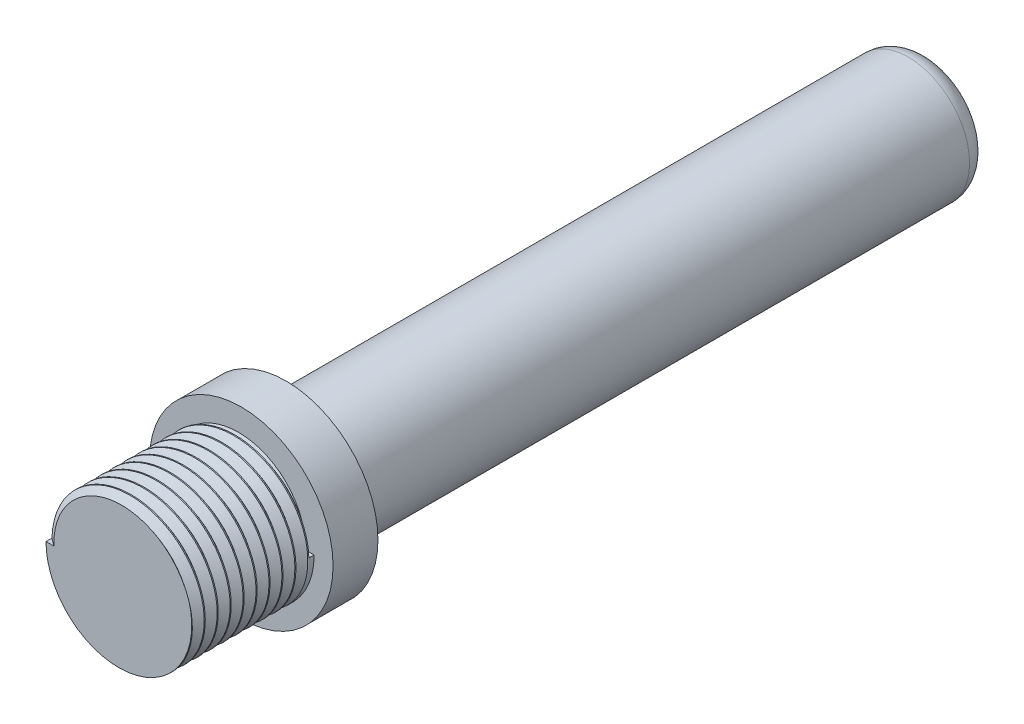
ISO-10303-21;
HEADER;
FILE_DESCRIPTION(('STEP AP214'),'2;1');
FILE_NAME('part.step','',(''),(''),'','','');
FILE_SCHEMA(('AUTOMOTIVE_DESIGN { 1 0 10303 214 1 1 1 1 }'));
ENDSEC;
DATA;
#1=APPLICATION_CONTEXT('core data for automotive mechanical design processes');
#2=APPLICATION_PROTOCOL_DEFINITION('international standard','automotive_design',2000,#1);
#3=PRODUCT_CONTEXT('',#1,'mechanical');
#4=PRODUCT('Part','Part','',(#3));
#5=PRODUCT_RELATED_PRODUCT_CATEGORY('part','',(#4));
#6=PRODUCT_DEFINITION_FORMATION('','',#4);
#7=PRODUCT_DEFINITION_CONTEXT('part definition',#1,'design');
#8=PRODUCT_DEFINITION('design','',#6,#7);
#9=PRODUCT_DEFINITION_SHAPE('','',#8);
#10=(LENGTH_UNIT() NAMED_UNIT(*) SI_UNIT(.MILLI.,.METRE.));
#11=(NAMED_UNIT(*) PLANE_ANGLE_UNIT() SI_UNIT($,.RADIAN.));
#12=(NAMED_UNIT(*) SI_UNIT($,.STERADIAN.) SOLID_ANGLE_UNIT());
#13=UNCERTAINTY_MEASURE_WITH_UNIT(LENGTH_MEASURE(1.E-05),#10,'distance_accuracy_value','');
#14=(GEOMETRIC_REPRESENTATION_CONTEXT(3) GLOBAL_UNCERTAINTY_ASSIGNED_CONTEXT((#13)) GLOBAL_UNIT_ASSIGNED_CONTEXT((#10,
#11,#12)) REPRESENTATION_CONTEXT('',''));
#15=CARTESIAN_POINT('',(0.,0.,0.));
#16=DIRECTION('',(0.,0.,1.));
#17=DIRECTION('',(1.,0.,0.));
#18=AXIS2_PLACEMENT_3D('',#15,#16,#17);
#19=CARTESIAN_POINT('',(-172.5,0.,-62.1));
#20=DIRECTION('',(0.,0.,1.));
#21=DIRECTION('',(1.,0.,0.));
#22=AXIS2_PLACEMENT_3D('',#19,#20,#21);
#23=CYLINDRICAL_SURFACE('',#22,7.14500000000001);
#24=DIRECTION('',(0.,0.,1.));
#25=VECTOR('',#24,1.);
#26=CARTESIAN_POINT('',(-165.355000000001,-3.62593244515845E-06,-62.1));
#27=LINE('',#26,#25);
#28=CARTESIAN_POINT('',(-165.354999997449,-3.62593244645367E-06,-78.5838147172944));
#29=VERTEX_POINT('',#28);
#30=CARTESIAN_POINT('',(-165.355000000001,-3.62593244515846E-06,-79.1));
#31=VERTEX_POINT('',#30);
#32=EDGE_CURVE('E98',#29,#31,#27,.F.);
#33=ORIENTED_EDGE('',*,*,#32,.F.);
#34=CARTESIAN_POINT('',(-179.645,0.,-66.5188146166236));
#35=CARTESIAN_POINT('',(-179.645,2.95955590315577,-66.5981896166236));
#36=CARTESIAN_POINT('',(-177.552277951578,5.05227795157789,-66.6775646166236));
#37=CARTESIAN_POINT('',(-175.459555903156,7.14500000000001,-66.7569396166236));
#38=CARTESIAN_POINT('',(-172.5,7.14500000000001,-66.8363146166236));
#39=CARTESIAN_POINT('',(-169.540444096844,7.14500000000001,-66.9156896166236));
#40=CARTESIAN_POINT('',(-167.447722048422,5.05227795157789,-66.9950646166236));
#41=CARTESIAN_POINT('',(-165.355,2.95955590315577,-67.0744396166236));
#42=CARTESIAN_POINT('',(-165.355,0.,-67.1538146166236));
#43=CARTESIAN_POINT('',(-165.355,-2.95955590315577,-67.2331896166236));
#44=CARTESIAN_POINT('',(-167.447722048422,-5.05227795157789,-67.3125646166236));
#45=CARTESIAN_POINT('',(-169.540444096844,-7.14500000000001,-67.3919396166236));
#46=CARTESIAN_POINT('',(-172.5,-7.14500000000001,-67.4713146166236));
#47=CARTESIAN_POINT('',(-175.459555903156,-7.14500000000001,-67.5506896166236));
#48=CARTESIAN_POINT('',(-177.552277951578,-5.05227795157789,-67.6300646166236));
#49=CARTESIAN_POINT('',(-179.645,-2.95955590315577,-67.7094396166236));
#50=CARTESIAN_POINT('',(-179.645,0.,-67.7888146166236));
#51=CARTESIAN_POINT('',(-179.645,2.95955590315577,-67.8681896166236));
#52=CARTESIAN_POINT('',(-177.552277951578,5.05227795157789,-67.9475646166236));
#53=CARTESIAN_POINT('',(-175.459555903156,7.14500000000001,-68.0269396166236));
#54=CARTESIAN_POINT('',(-172.5,7.14500000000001,-68.1063146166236));
#55=CARTESIAN_POINT('',(-169.540444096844,7.14500000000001,-68.1856896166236));
#56=CARTESIAN_POINT('',(-167.447722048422,5.05227795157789,-68.2650646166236));
#57=CARTESIAN_POINT('',(-165.355,2.95955590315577,-68.3444396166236));
#58=CARTESIAN_POINT('',(-165.355,0.,-68.4238146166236));
#59=CARTESIAN_POINT('',(-165.355,-2.95955590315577,-68.5031896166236));
#60=CARTESIAN_POINT('',(-167.447722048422,-5.05227795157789,-68.5825646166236));
#61=CARTESIAN_POINT('',(-169.540444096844,-7.14500000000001,-68.6619396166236));
#62=CARTESIAN_POINT('',(-172.5,-7.14500000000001,-68.7413146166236));
#63=CARTESIAN_POINT('',(-175.459555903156,-7.14500000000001,-68.8206896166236));
#64=CARTESIAN_POINT('',(-177.552277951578,-5.05227795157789,-68.9000646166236));
#65=CARTESIAN_POINT('',(-179.645,-2.95955590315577,-68.9794396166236));
#66=CARTESIAN_POINT('',(-179.645,0.,-69.0588146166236));
#67=CARTESIAN_POINT('',(-179.645,2.95955590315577,-69.1381896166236));
#68=CARTESIAN_POINT('',(-177.552277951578,5.05227795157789,-69.2175646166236));
#69=CARTESIAN_POINT('',(-175.459555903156,7.14500000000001,-69.2969396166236));
#70=CARTESIAN_POINT('',(-172.5,7.14500000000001,-69.3763146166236));
#71=CARTESIAN_POINT('',(-169.540444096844,7.14500000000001,-69.4556896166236));
#72=CARTESIAN_POINT('',(-167.447722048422,5.05227795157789,-69.5350646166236));
#73=CARTESIAN_POINT('',(-165.355,2.95955590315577,-69.6144396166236));
#74=CARTESIAN_POINT('',(-165.355,0.,-69.6938146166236));
#75=CARTESIAN_POINT('',(-165.355,-2.95955590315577,-69.7731896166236));
#76=CARTESIAN_POINT('',(-167.447722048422,-5.05227795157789,-69.8525646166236));
#77=CARTESIAN_POINT('',(-169.540444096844,-7.14500000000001,-69.9319396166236));
#78=CARTESIAN_POINT('',(-172.5,-7.14500000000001,-70.0113146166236));
#79=CARTESIAN_POINT('',(-175.459555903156,-7.14500000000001,-70.0906896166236));
#80=CARTESIAN_POINT('',(-177.552277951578,-5.05227795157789,-70.1700646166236));
#81=CARTESIAN_POINT('',(-179.645,-2.95955590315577,-70.2494396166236));
#82=CARTESIAN_POINT('',(-179.645,0.,-70.3288146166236));
#83=CARTESIAN_POINT('',(-179.645,2.95955590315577,-70.4081896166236));
#84=CARTESIAN_POINT('',(-177.552277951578,5.05227795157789,-70.4875646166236));
#85=CARTESIAN_POINT('',(-175.459555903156,7.14500000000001,-70.5669396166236));
#86=CARTESIAN_POINT('',(-172.5,7.14500000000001,-70.6463146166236));
#87=CARTESIAN_POINT('',(-169.540444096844,7.14500000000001,-70.7256896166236));
#88=CARTESIAN_POINT('',(-167.447722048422,5.05227795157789,-70.8050646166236));
#89=CARTESIAN_POINT('',(-165.355,2.95955590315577,-70.8844396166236));
#90=CARTESIAN_POINT('',(-165.355,0.,-70.9638146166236));
#91=CARTESIAN_POINT('',(-165.355,-2.95955590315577,-71.0431896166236));
#92=CARTESIAN_POINT('',(-167.447722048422,-5.05227795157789,-71.1225646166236));
#93=CARTESIAN_POINT('',(-169.540444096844,-7.14500000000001,-71.2019396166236));
#94=CARTESIAN_POINT('',(-172.5,-7.14500000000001,-71.2813146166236));
#95=CARTESIAN_POINT('',(-175.459555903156,-7.14500000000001,-71.3606896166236));
#96=CARTESIAN_POINT('',(-177.552277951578,-5.05227795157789,-71.4400646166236));
#97=CARTESIAN_POINT('',(-179.645,-2.95955590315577,-71.5194396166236));
#98=CARTESIAN_POINT('',(-179.645,0.,-71.5988146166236));
#99=CARTESIAN_POINT('',(-179.645,2.95955590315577,-71.6781896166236));
#100=CARTESIAN_POINT('',(-177.552277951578,5.05227795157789,-71.7575646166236));
#101=CARTESIAN_POINT('',(-175.459555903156,7.14500000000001,-71.8369396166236));
#102=CARTESIAN_POINT('',(-172.5,7.14500000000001,-71.9163146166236));
#103=CARTESIAN_POINT('',(-169.540444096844,7.14500000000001,-71.9956896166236));
#104=CARTESIAN_POINT('',(-167.447722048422,5.05227795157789,-72.0750646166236));
#105=CARTESIAN_POINT('',(-165.355,2.95955590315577,-72.1544396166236));
#106=CARTESIAN_POINT('',(-165.355,0.,-72.2338146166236));
#107=CARTESIAN_POINT('',(-165.355,-2.95955590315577,-72.3131896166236));
#108=CARTESIAN_POINT('',(-167.447722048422,-5.05227795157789,-72.3925646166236));
#109=CARTESIAN_POINT('',(-169.540444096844,-7.14500000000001,-72.4719396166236));
#110=CARTESIAN_POINT('',(-172.5,-7.14500000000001,-72.5513146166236));
#111=CARTESIAN_POINT('',(-175.459555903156,-7.14500000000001,-72.6306896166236));
#112=CARTESIAN_POINT('',(-177.552277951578,-5.05227795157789,-72.7100646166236));
#113=CARTESIAN_POINT('',(-179.645,-2.95955590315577,-72.7894396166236));
#114=CARTESIAN_POINT('',(-179.645,0.,-72.8688146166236));
#115=CARTESIAN_POINT('',(-179.645,2.95955590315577,-72.9481896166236));
#116=CARTESIAN_POINT('',(-177.552277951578,5.05227795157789,-73.0275646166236));
#117=CARTESIAN_POINT('',(-175.459555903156,7.14500000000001,-73.1069396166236));
#118=CARTESIAN_POINT('',(-172.5,7.14500000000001,-73.1863146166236));
#119=CARTESIAN_POINT('',(-169.540444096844,7.14500000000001,-73.2656896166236));
#120=CARTESIAN_POINT('',(-167.447722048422,5.05227795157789,-73.3450646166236));
#121=CARTESIAN_POINT('',(-165.355,2.95955590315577,-73.4244396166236));
#122=CARTESIAN_POINT('',(-165.355,0.,-73.5038146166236));
#123=CARTESIAN_POINT('',(-165.355,-2.95955590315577,-73.5831896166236));
#124=CARTESIAN_POINT('',(-167.447722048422,-5.05227795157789,-73.6625646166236));
#125=CARTESIAN_POINT('',(-169.540444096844,-7.14500000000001,-73.7419396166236));
#126=CARTESIAN_POINT('',(-172.5,-7.14500000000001,-73.8213146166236));
#127=CARTESIAN_POINT('',(-175.459555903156,-7.14500000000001,-73.9006896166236));
#128=CARTESIAN_POINT('',(-177.552277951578,-5.05227795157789,-73.9800646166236));
#129=CARTESIAN_POINT('',(-179.645,-2.95955590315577,-74.0594396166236));
#130=CARTESIAN_POINT('',(-179.645,0.,-74.1388146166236));
#131=CARTESIAN_POINT('',(-179.645,2.95955590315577,-74.2181896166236));
#132=CARTESIAN_POINT('',(-177.552277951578,5.05227795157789,-74.2975646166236));
#133=CARTESIAN_POINT('',(-175.459555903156,7.14500000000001,-74.3769396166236));
#134=CARTESIAN_POINT('',(-172.5,7.14500000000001,-74.4563146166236));
#135=CARTESIAN_POINT('',(-169.540444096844,7.14500000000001,-74.5356896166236));
#136=CARTESIAN_POINT('',(-167.447722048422,5.05227795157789,-74.6150646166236));
#137=CARTESIAN_POINT('',(-165.355,2.95955590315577,-74.6944396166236));
#138=CARTESIAN_POINT('',(-165.355,0.,-74.7738146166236));
#139=CARTESIAN_POINT('',(-165.355,-2.95955590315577,-74.8531896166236));
#140=CARTESIAN_POINT('',(-167.447722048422,-5.05227795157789,-74.9325646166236));
#141=CARTESIAN_POINT('',(-169.540444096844,-7.14500000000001,-75.0119396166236));
#142=CARTESIAN_POINT('',(-172.5,-7.14500000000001,-75.0913146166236));
#143=CARTESIAN_POINT('',(-175.459555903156,-7.14500000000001,-75.1706896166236));
#144=CARTESIAN_POINT('',(-177.552277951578,-5.05227795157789,-75.2500646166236));
#145=CARTESIAN_POINT('',(-179.645,-2.95955590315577,-75.3294396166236));
#146=CARTESIAN_POINT('',(-179.645,0.,-75.4088146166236));
#147=CARTESIAN_POINT('',(-179.645,2.95955590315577,-75.4881896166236));
#148=CARTESIAN_POINT('',(-177.552277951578,5.05227795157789,-75.5675646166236));
#149=CARTESIAN_POINT('',(-175.459555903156,7.14500000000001,-75.6469396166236));
#150=CARTESIAN_POINT('',(-172.5,7.14500000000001,-75.7263146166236));
#151=CARTESIAN_POINT('',(-169.540444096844,7.14500000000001,-75.8056896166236));
#152=CARTESIAN_POINT('',(-167.447722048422,5.05227795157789,-75.8850646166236));
#153=CARTESIAN_POINT('',(-165.355,2.95955590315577,-75.9644396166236));
#154=CARTESIAN_POINT('',(-165.355,0.,-76.0438146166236));
#155=CARTESIAN_POINT('',(-165.355,-2.95955590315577,-76.1231896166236));
#156=CARTESIAN_POINT('',(-167.447722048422,-5.05227795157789,-76.2025646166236));
#157=CARTESIAN_POINT('',(-169.540444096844,-7.14500000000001,-76.2819396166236));
#158=CARTESIAN_POINT('',(-172.5,-7.14500000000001,-76.3613146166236));
#159=CARTESIAN_POINT('',(-175.459555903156,-7.14500000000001,-76.4406896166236));
#160=CARTESIAN_POINT('',(-177.552277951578,-5.05227795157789,-76.5200646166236));
#161=CARTESIAN_POINT('',(-179.645,-2.95955590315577,-76.5994396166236));
#162=CARTESIAN_POINT('',(-179.645,0.,-76.6788146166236));
#163=CARTESIAN_POINT('',(-179.645,2.95955590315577,-76.7581896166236));
#164=CARTESIAN_POINT('',(-177.552277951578,5.05227795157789,-76.8375646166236));
#165=CARTESIAN_POINT('',(-175.459555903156,7.14500000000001,-76.9169396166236));
#166=CARTESIAN_POINT('',(-172.5,7.14500000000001,-76.9963146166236));
#167=CARTESIAN_POINT('',(-169.540444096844,7.14500000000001,-77.0756896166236));
#168=CARTESIAN_POINT('',(-167.447722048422,5.05227795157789,-77.1550646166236));
#169=CARTESIAN_POINT('',(-165.355,2.95955590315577,-77.2344396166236));
#170=CARTESIAN_POINT('',(-165.355,0.,-77.3138146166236));
#171=CARTESIAN_POINT('',(-165.355,-2.95955590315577,-77.3931896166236));
#172=CARTESIAN_POINT('',(-167.447722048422,-5.05227795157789,-77.4725646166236));
#173=CARTESIAN_POINT('',(-169.540444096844,-7.14500000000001,-77.5519396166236));
#174=CARTESIAN_POINT('',(-172.5,-7.14500000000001,-77.6313146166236));
#175=CARTESIAN_POINT('',(-175.459555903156,-7.14500000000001,-77.7106896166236));
#176=CARTESIAN_POINT('',(-177.552277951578,-5.05227795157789,-77.7900646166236));
#177=CARTESIAN_POINT('',(-179.645,-2.95955590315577,-77.8694396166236));
#178=CARTESIAN_POINT('',(-179.645,0.,-77.9488146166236));
#179=CARTESIAN_POINT('',(-179.645,2.95955590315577,-78.0281896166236));
#180=CARTESIAN_POINT('',(-177.552277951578,5.05227795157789,-78.1075646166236));
#181=CARTESIAN_POINT('',(-175.459555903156,7.14500000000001,-78.1869396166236));
#182=CARTESIAN_POINT('',(-172.5,7.14500000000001,-78.2663146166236));
#183=CARTESIAN_POINT('',(-169.540444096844,7.14500000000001,-78.3456896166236));
#184=CARTESIAN_POINT('',(-167.447722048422,5.05227795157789,-78.4250646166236));
#185=CARTESIAN_POINT('',(-165.355,2.95955590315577,-78.5044396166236));
#186=CARTESIAN_POINT('',(-165.355,0.,-78.5838146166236));
#187=CARTESIAN_POINT('',(-165.355,-2.95955590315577,-78.6631896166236));
#188=CARTESIAN_POINT('',(-167.447722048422,-5.05227795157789,-78.7425646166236));
#189=CARTESIAN_POINT('',(-169.540444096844,-7.14500000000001,-78.8219396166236));
#190=CARTESIAN_POINT('',(-172.5,-7.14500000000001,-78.9013146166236));
#191=CARTESIAN_POINT('',(-175.459555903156,-7.14500000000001,-78.9806896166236));
#192=CARTESIAN_POINT('',(-177.552277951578,-5.05227795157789,-79.0600646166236));
#193=CARTESIAN_POINT('',(-179.645,-2.95955590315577,-79.1394396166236));
#194=CARTESIAN_POINT('',(-179.645,0.,-79.2188146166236));
#195=(BOUNDED_CURVE() B_SPLINE_CURVE(2,(#34,#35,#36,#37,#38,#39,#40,#41,#42,#43,#44,#45,#46,#47,
#48,#49,#50,#51,#52,#53,#54,#55,#56,#57,#58,#59,#60,#61,#62,#63,#64,#65,#66,#67,#68,#69,#70,#71,
#72,#73,#74,#75,#76,#77,#78,#79,#80,#81,#82,#83,#84,#85,#86,#87,#88,#89,#90,#91,#92,#93,#94,#95,
#96,#97,#98,#99,#100,#101,#102,#103,#104,#105,#106,#107,#108,#109,#110,#111,#112,#113,#114,#115,
#116,#117,#118,#119,#120,#121,#122,#123,#124,#125,#126,#127,#128,#129,#130,#131,#132,#133,#134,
#135,#136,#137,#138,#139,#140,#141,#142,#143,#144,#145,#146,#147,#148,#149,#150,#151,#152,#153,
#154,#155,#156,#157,#158,#159,#160,#161,#162,#163,#164,#165,#166,#167,#168,#169,#170,#171,#172,
#173,#174,#175,#176,#177,#178,#179,#180,#181,#182,#183,#184,#185,#186,#187,#188,#189,#190,#191,
#192,#193,#194),.UNSPECIFIED.,.F.,.F.) B_SPLINE_CURVE_WITH_KNOTS((3,2,2,2,2,2,2,2,2,2,2,2,2,2,2,
2,2,2,2,2,2,2,2,2,2,2,2,2,2,2,2,2,2,2,2,2,2,2,2,2,2,2,2,2,2,2,2,2,2,2,2,2,2,2,2,2,2,2,2,2,2,2,2,
2,2,2,2,2,2,2,2,2,2,2,2,2,2,2,2,2,3),(0.,0.0125,0.025,0.0375,0.05,0.0625,0.075,0.0875,0.1,
0.1125,0.125,0.1375,0.15,0.1625,0.175,0.1875,0.2,0.2125,0.225,0.2375,0.25,0.2625,0.275,0.2875,
0.3,0.3125,0.325,0.3375,0.35,0.3625,0.375,0.3875,0.4,0.4125,0.425,0.4375,0.45,0.4625,0.475,
0.4875,0.5,0.5125,0.525,0.5375,0.55,0.5625,0.575,0.5875,0.6,0.6125,0.625,0.6375,0.65,0.6625,
0.675,0.6875,0.7,0.7125,0.725,0.7375,0.75,0.7625,0.775,0.7875,0.8,0.8125,0.825,0.8375,0.85,
0.8625,0.875,0.8875,0.9,0.9125,0.925,0.9375,0.95,0.9625,0.975,0.9875,1.),
.UNSPECIFIED.) CURVE() GEOMETRIC_REPRESENTATION_ITEM() RATIONAL_B_SPLINE_CURVE((1.,
0.923879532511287,1.,0.923879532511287,1.,0.923879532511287,1.,0.923879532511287,1.,
0.923879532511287,1.,0.923879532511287,1.,0.923879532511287,1.,0.923879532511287,1.,
0.923879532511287,1.,0.923879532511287,1.,0.923879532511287,1.,0.923879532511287,1.,
0.923879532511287,1.,0.923879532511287,1.,0.923879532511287,1.,0.923879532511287,1.,
0.923879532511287,1.,0.923879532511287,1.,0.923879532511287,1.,0.923879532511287,1.,
0.923879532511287,1.,0.923879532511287,1.,0.923879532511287,1.,0.923879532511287,1.,
0.923879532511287,1.,0.923879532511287,1.,0.923879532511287,1.,0.923879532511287,1.,
0.923879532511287,1.,0.923879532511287,1.,0.923879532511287,1.,0.923879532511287,1.,
0.923879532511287,1.,0.923879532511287,1.,0.923879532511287,1.,0.923879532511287,1.,
0.923879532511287,1.,0.923879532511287,1.,0.923879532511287,1.,0.923879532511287,1.,
0.923879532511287,1.,0.923879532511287,1.,0.923879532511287,1.,0.923879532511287,1.,
0.923879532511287,1.,0.923879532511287,1.,0.923879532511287,1.,0.923879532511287,1.,
0.923879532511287,1.,0.923879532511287,1.,0.923879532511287,1.,0.923879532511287,1.,
0.923879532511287,1.,0.923879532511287,1.,0.923879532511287,1.,0.923879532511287,1.,
0.923879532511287,1.,0.923879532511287,1.,0.923879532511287,1.,0.923879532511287,1.,
0.923879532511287,1.,0.923879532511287,1.,0.923879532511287,1.,0.923879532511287,1.,
0.923879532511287,1.,0.923879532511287,1.,0.923879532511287,1.,0.923879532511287,1.,
0.923879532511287,1.,0.923879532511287,1.,0.923879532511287,1.,0.923879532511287,1.,
0.923879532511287,1.,0.923879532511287,1.,0.923879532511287,1.,0.923879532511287,1.,
0.923879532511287,1.,0.923879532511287,1.,0.923879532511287,1.,0.923879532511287,1.)) REPRESENTATION_ITEM(''));
#196=CARTESIAN_POINT('',(-165.612245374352,1.89996347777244,-67.1));
#197=VERTEX_POINT('',#196);
#198=EDGE_CURVE('E91',#29,#197,#195,.F.);
#199=ORIENTED_EDGE('',*,*,#198,.T.);
#200=CARTESIAN_POINT('',(-172.5,0.,-67.1));
#201=DIRECTION('',(0.,0.,1.));
#202=DIRECTION('',(1.,0.,0.));
#203=AXIS2_PLACEMENT_3D('',#200,#201,#202);
#204=CIRCLE('',#203,7.14500000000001);
#205=CARTESIAN_POINT('',(-179.645,0.,-67.1));
#206=VERTEX_POINT('',#205);
#207=EDGE_CURVE('E209',#206,#197,#204,.T.);
#208=ORIENTED_EDGE('',*,*,#207,.F.);
#209=DIRECTION('',(0.,0.,1.));
#210=VECTOR('',#209,1.);
#211=CARTESIAN_POINT('',(-179.645,0.,-62.1));
#212=LINE('',#211,#210);
#213=CARTESIAN_POINT('',(-179.645,0.,-67.6811853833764));
#214=VERTEX_POINT('',#213);
#215=EDGE_CURVE('E212',#206,#214,#212,.F.);
#216=ORIENTED_EDGE('',*,*,#215,.T.);
#217=CARTESIAN_POINT('',(-179.645,0.,-67.6811853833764));
#218=CARTESIAN_POINT('',(-179.645,2.95955590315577,-67.7605603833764));
#219=CARTESIAN_POINT('',(-177.552277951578,5.05227795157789,-67.8399353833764));
#220=CARTESIAN_POINT('',(-175.459555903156,7.14500000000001,-67.9193103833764));
#221=CARTESIAN_POINT('',(-172.5,7.14500000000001,-67.9986853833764));
#222=CARTESIAN_POINT('',(-169.540444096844,7.14500000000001,-68.0780603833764));
#223=CARTESIAN_POINT('',(-167.447722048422,5.05227795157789,-68.1574353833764));
#224=CARTESIAN_POINT('',(-165.355,2.95955590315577,-68.2368103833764));
#225=CARTESIAN_POINT('',(-165.355,0.,-68.3161853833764));
#226=CARTESIAN_POINT('',(-165.355,-2.95955590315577,-68.3955603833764));
#227=CARTESIAN_POINT('',(-167.447722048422,-5.05227795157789,-68.4749353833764));
#228=CARTESIAN_POINT('',(-169.540444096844,-7.14500000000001,-68.5543103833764));
#229=CARTESIAN_POINT('',(-172.5,-7.14500000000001,-68.6336853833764));
#230=CARTESIAN_POINT('',(-175.459555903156,-7.14500000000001,-68.7130603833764));
#231=CARTESIAN_POINT('',(-177.552277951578,-5.05227795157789,-68.7924353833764));
#232=CARTESIAN_POINT('',(-179.645,-2.95955590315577,-68.8718103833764));
#233=CARTESIAN_POINT('',(-179.645,0.,-68.9511853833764));
#234=CARTESIAN_POINT('',(-179.645,2.95955590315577,-69.0305603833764));
#235=CARTESIAN_POINT('',(-177.552277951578,5.05227795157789,-69.1099353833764));
#236=CARTESIAN_POINT('',(-175.459555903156,7.14500000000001,-69.1893103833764));
#237=CARTESIAN_POINT('',(-172.5,7.14500000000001,-69.2686853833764));
#238=CARTESIAN_POINT('',(-169.540444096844,7.14500000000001,-69.3480603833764));
#239=CARTESIAN_POINT('',(-167.447722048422,5.05227795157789,-69.4274353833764));
#240=CARTESIAN_POINT('',(-165.355,2.95955590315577,-69.5068103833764));
#241=CARTESIAN_POINT('',(-165.355,0.,-69.5861853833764));
#242=CARTESIAN_POINT('',(-165.355,-2.95955590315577,-69.6655603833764));
#243=CARTESIAN_POINT('',(-167.447722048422,-5.05227795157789,-69.7449353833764));
#244=CARTESIAN_POINT('',(-169.540444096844,-7.14500000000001,-69.8243103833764));
#245=CARTESIAN_POINT('',(-172.5,-7.14500000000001,-69.9036853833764));
#246=CARTESIAN_POINT('',(-175.459555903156,-7.14500000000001,-69.9830603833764));
#247=CARTESIAN_POINT('',(-177.552277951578,-5.05227795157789,-70.0624353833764));
#248=CARTESIAN_POINT('',(-179.645,-2.95955590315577,-70.1418103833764));
#249=CARTESIAN_POINT('',(-179.645,0.,-70.2211853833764));
#250=CARTESIAN_POINT('',(-179.645,2.95955590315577,-70.3005603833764));
#251=CARTESIAN_POINT('',(-177.552277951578,5.05227795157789,-70.3799353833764));
#252=CARTESIAN_POINT('',(-175.459555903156,7.14500000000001,-70.4593103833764));
#253=CARTESIAN_POINT('',(-172.5,7.14500000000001,-70.5386853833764));
#254=CARTESIAN_POINT('',(-169.540444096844,7.14500000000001,-70.6180603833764));
#255=CARTESIAN_POINT('',(-167.447722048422,5.05227795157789,-70.6974353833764));
#256=CARTESIAN_POINT('',(-165.355,2.95955590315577,-70.7768103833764));
#257=CARTESIAN_POINT('',(-165.355,0.,-70.8561853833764));
#258=CARTESIAN_POINT('',(-165.355,-2.95955590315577,-70.9355603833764));
#259=CARTESIAN_POINT('',(-167.447722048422,-5.05227795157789,-71.0149353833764));
#260=CARTESIAN_POINT('',(-169.540444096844,-7.14500000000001,-71.0943103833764));
#261=CARTESIAN_POINT('',(-172.5,-7.14500000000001,-71.1736853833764));
#262=CARTESIAN_POINT('',(-175.459555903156,-7.14500000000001,-71.2530603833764));
#263=CARTESIAN_POINT('',(-177.552277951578,-5.05227795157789,-71.3324353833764));
#264=CARTESIAN_POINT('',(-179.645,-2.95955590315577,-71.4118103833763));
#265=CARTESIAN_POINT('',(-179.645,0.,-71.4911853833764));
#266=CARTESIAN_POINT('',(-179.645,2.95955590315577,-71.5705603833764));
#267=CARTESIAN_POINT('',(-177.552277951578,5.05227795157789,-71.6499353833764));
#268=CARTESIAN_POINT('',(-175.459555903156,7.14500000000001,-71.7293103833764));
#269=CARTESIAN_POINT('',(-172.5,7.14500000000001,-71.8086853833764));
#270=CARTESIAN_POINT('',(-169.540444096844,7.14500000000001,-71.8880603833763));
#271=CARTESIAN_POINT('',(-167.447722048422,5.05227795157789,-71.9674353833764));
#272=CARTESIAN_POINT('',(-165.355,2.95955590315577,-72.0468103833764));
#273=CARTESIAN_POINT('',(-165.355,0.,-72.1261853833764));
#274=CARTESIAN_POINT('',(-165.355,-2.95955590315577,-72.2055603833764));
#275=CARTESIAN_POINT('',(-167.447722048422,-5.05227795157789,-72.2849353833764));
#276=CARTESIAN_POINT('',(-169.540444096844,-7.14500000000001,-72.3643103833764));
#277=CARTESIAN_POINT('',(-172.5,-7.14500000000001,-72.4436853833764));
#278=CARTESIAN_POINT('',(-175.459555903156,-7.14500000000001,-72.5230603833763));
#279=CARTESIAN_POINT('',(-177.552277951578,-5.05227795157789,-72.6024353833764));
#280=CARTESIAN_POINT('',(-179.645,-2.95955590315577,-72.6818103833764));
#281=CARTESIAN_POINT('',(-179.645,0.,-72.7611853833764));
#282=CARTESIAN_POINT('',(-179.645,2.95955590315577,-72.8405603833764));
#283=CARTESIAN_POINT('',(-177.552277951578,5.05227795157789,-72.9199353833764));
#284=CARTESIAN_POINT('',(-175.459555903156,7.14500000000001,-72.9993103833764));
#285=CARTESIAN_POINT('',(-172.5,7.14500000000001,-73.0786853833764));
#286=CARTESIAN_POINT('',(-169.540444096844,7.14500000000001,-73.1580603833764));
#287=CARTESIAN_POINT('',(-167.447722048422,5.05227795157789,-73.2374353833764));
#288=CARTESIAN_POINT('',(-165.355,2.95955590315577,-73.3168103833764));
#289=CARTESIAN_POINT('',(-165.355,0.,-73.3961853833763));
#290=CARTESIAN_POINT('',(-165.355,-2.95955590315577,-73.4755603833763));
#291=CARTESIAN_POINT('',(-167.447722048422,-5.05227795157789,-73.5549353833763));
#292=CARTESIAN_POINT('',(-169.540444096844,-7.14500000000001,-73.6343103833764));
#293=CARTESIAN_POINT('',(-172.5,-7.14500000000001,-73.7136853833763));
#294=CARTESIAN_POINT('',(-175.459555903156,-7.14500000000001,-73.7930603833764));
#295=CARTESIAN_POINT('',(-177.552277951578,-5.05227795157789,-73.8724353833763));
#296=CARTESIAN_POINT('',(-179.645,-2.95955590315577,-73.9518103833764));
#297=CARTESIAN_POINT('',(-179.645,0.,-74.0311853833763));
#298=CARTESIAN_POINT('',(-179.645,2.95955590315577,-74.1105603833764));
#299=CARTESIAN_POINT('',(-177.552277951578,5.05227795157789,-74.1899353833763));
#300=CARTESIAN_POINT('',(-175.459555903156,7.14500000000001,-74.2693103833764));
#301=CARTESIAN_POINT('',(-172.5,7.14500000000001,-74.3486853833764));
#302=CARTESIAN_POINT('',(-169.540444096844,7.14500000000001,-74.4280603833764));
#303=CARTESIAN_POINT('',(-167.447722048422,5.05227795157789,-74.5074353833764));
#304=CARTESIAN_POINT('',(-165.355,2.95955590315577,-74.5868103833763));
#305=CARTESIAN_POINT('',(-165.355,0.,-74.6661853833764));
#306=CARTESIAN_POINT('',(-165.355,-2.95955590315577,-74.7455603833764));
#307=CARTESIAN_POINT('',(-167.447722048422,-5.05227795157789,-74.8249353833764));
#308=CARTESIAN_POINT('',(-169.540444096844,-7.14500000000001,-74.9043103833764));
#309=CARTESIAN_POINT('',(-172.5,-7.14500000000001,-74.9836853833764));
#310=CARTESIAN_POINT('',(-175.459555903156,-7.14500000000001,-75.0630603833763));
#311=CARTESIAN_POINT('',(-177.552277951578,-5.05227795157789,-75.1424353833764));
#312=CARTESIAN_POINT('',(-179.645,-2.95955590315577,-75.2218103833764));
#313=CARTESIAN_POINT('',(-179.645,0.,-75.3011853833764));
#314=CARTESIAN_POINT('',(-179.645,2.95955590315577,-75.3805603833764));
#315=CARTESIAN_POINT('',(-177.552277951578,5.05227795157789,-75.4599353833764));
#316=CARTESIAN_POINT('',(-175.459555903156,7.14500000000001,-75.5393103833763));
#317=CARTESIAN_POINT('',(-172.5,7.14500000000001,-75.6186853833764));
#318=CARTESIAN_POINT('',(-169.540444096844,7.14500000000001,-75.6980603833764));
#319=CARTESIAN_POINT('',(-167.447722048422,5.05227795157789,-75.7774353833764));
#320=CARTESIAN_POINT('',(-165.355,2.95955590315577,-75.8568103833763));
#321=CARTESIAN_POINT('',(-165.355,0.,-75.9361853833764));
#322=CARTESIAN_POINT('',(-165.355,-2.95955590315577,-76.0155603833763));
#323=CARTESIAN_POINT('',(-167.447722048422,-5.05227795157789,-76.0949353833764));
#324=CARTESIAN_POINT('',(-169.540444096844,-7.14500000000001,-76.1743103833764));
#325=CARTESIAN_POINT('',(-172.5,-7.14500000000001,-76.2536853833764));
#326=CARTESIAN_POINT('',(-175.459555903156,-7.14500000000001,-76.3330603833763));
#327=CARTESIAN_POINT('',(-177.552277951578,-5.05227795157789,-76.4124353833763));
#328=CARTESIAN_POINT('',(-179.645,-2.95955590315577,-76.4918103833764));
#329=CARTESIAN_POINT('',(-179.645,0.,-76.5711853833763));
#330=CARTESIAN_POINT('',(-179.645,2.95955590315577,-76.6505603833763));
#331=CARTESIAN_POINT('',(-177.552277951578,5.05227795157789,-76.7299353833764));
#332=CARTESIAN_POINT('',(-175.459555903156,7.14500000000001,-76.8093103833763));
#333=CARTESIAN_POINT('',(-172.5,7.14500000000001,-76.8886853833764));
#334=CARTESIAN_POINT('',(-169.540444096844,7.14500000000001,-76.9680603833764));
#335=CARTESIAN_POINT('',(-167.447722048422,5.05227795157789,-77.0474353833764));
#336=CARTESIAN_POINT('',(-165.355,2.95955590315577,-77.1268103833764));
#337=CARTESIAN_POINT('',(-165.355,0.,-77.2061853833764));
#338=CARTESIAN_POINT('',(-165.355,-2.95955590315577,-77.2855603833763));
#339=CARTESIAN_POINT('',(-167.447722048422,-5.05227795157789,-77.3649353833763));
#340=CARTESIAN_POINT('',(-169.540444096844,-7.14500000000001,-77.4443103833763));
#341=CARTESIAN_POINT('',(-172.5,-7.14500000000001,-77.5236853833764));
#342=CARTESIAN_POINT('',(-175.459555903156,-7.14500000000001,-77.6030603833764));
#343=CARTESIAN_POINT('',(-177.552277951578,-5.05227795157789,-77.6824353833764));
#344=CARTESIAN_POINT('',(-179.645,-2.95955590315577,-77.7618103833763));
#345=CARTESIAN_POINT('',(-179.645,0.,-77.8411853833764));
#346=CARTESIAN_POINT('',(-179.645,2.95955590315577,-77.9205603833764));
#347=CARTESIAN_POINT('',(-177.552277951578,5.05227795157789,-77.9999353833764));
#348=CARTESIAN_POINT('',(-175.459555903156,7.14500000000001,-78.0793103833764));
#349=CARTESIAN_POINT('',(-172.5,7.14500000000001,-78.1586853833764));
#350=CARTESIAN_POINT('',(-169.540444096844,7.14500000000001,-78.2380603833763));
#351=CARTESIAN_POINT('',(-167.447722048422,5.05227795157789,-78.3174353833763));
#352=CARTESIAN_POINT('',(-165.355,2.95955590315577,-78.3968103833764));
#353=CARTESIAN_POINT('',(-165.355,0.,-78.4761853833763));
#354=CARTESIAN_POINT('',(-165.355,-2.95955590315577,-78.5555603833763));
#355=CARTESIAN_POINT('',(-167.447722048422,-5.05227795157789,-78.6349353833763));
#356=CARTESIAN_POINT('',(-169.540444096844,-7.14500000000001,-78.7143103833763));
#357=CARTESIAN_POINT('',(-172.5,-7.14500000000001,-78.7936853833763));
#358=CARTESIAN_POINT('',(-175.459555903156,-7.14500000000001,-78.8730603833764));
#359=CARTESIAN_POINT('',(-177.552277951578,-5.05227795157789,-78.9524353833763));
#360=CARTESIAN_POINT('',(-179.645,-2.95955590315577,-79.0318103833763));
#361=CARTESIAN_POINT('',(-179.645,0.,-79.1111853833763));
#362=CARTESIAN_POINT('',(-179.645,2.95955590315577,-79.1905603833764));
#363=CARTESIAN_POINT('',(-177.552277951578,5.05227795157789,-79.2699353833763));
#364=CARTESIAN_POINT('',(-175.459555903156,7.14500000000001,-79.3493103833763));
#365=CARTESIAN_POINT('',(-172.5,7.14500000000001,-79.4286853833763));
#366=CARTESIAN_POINT('',(-169.540444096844,7.14500000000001,-79.5080603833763));
#367=CARTESIAN_POINT('',(-167.447722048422,5.05227795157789,-79.5874353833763));
#368=CARTESIAN_POINT('',(-165.355,2.95955590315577,-79.6668103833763));
#369=CARTESIAN_POINT('',(-165.355,0.,-79.7461853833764));
#370=CARTESIAN_POINT('',(-165.355,-2.95955590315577,-79.8255603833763));
#371=CARTESIAN_POINT('',(-167.447722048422,-5.05227795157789,-79.9049353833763));
#372=CARTESIAN_POINT('',(-169.540444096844,-7.14500000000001,-79.9843103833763));
#373=CARTESIAN_POINT('',(-172.5,-7.14500000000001,-80.0636853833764));
#374=CARTESIAN_POINT('',(-175.459555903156,-7.14500000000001,-80.1430603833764));
#375=CARTESIAN_POINT('',(-177.552277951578,-5.05227795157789,-80.2224353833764));
#376=CARTESIAN_POINT('',(-179.645,-2.95955590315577,-80.3018103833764));
#377=CARTESIAN_POINT('',(-179.645,0.,-80.3811853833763));
#378=(BOUNDED_CURVE() B_SPLINE_CURVE(2,(#217,#218,#219,#220,#221,#222,#223,#224,#225,#226,#227,
#228,#229,#230,#231,#232,#233,#234,#235,#236,#237,#238,#239,#240,#241,#242,#243,#244,#245,#246,
#247,#248,#249,#250,#251,#252,#253,#254,#255,#256,#257,#258,#259,#260,#261,#262,#263,#264,#265,
#266,#267,#268,#269,#270,#271,#272,#273,#274,#275,#276,#277,#278,#279,#280,#281,#282,#283,#284,
#285,#286,#287,#288,#289,#290,#291,#292,#293,#294,#295,#296,#297,#298,#299,#300,#301,#302,#303,
#304,#305,#306,#307,#308,#309,#310,#311,#312,#313,#314,#315,#316,#317,#318,#319,#320,#321,#322,
#323,#324,#325,#326,#327,#328,#329,#330,#331,#332,#333,#334,#335,#336,#337,#338,#339,#340,#341,
#342,#343,#344,#345,#346,#347,#348,#349,#350,#351,#352,#353,#354,#355,#356,#357,#358,#359,#360,
#361,#362,#363,#364,#365,#366,#367,#368,#369,#370,#371,#372,#373,#374,#375,#376,#377),
.UNSPECIFIED.,.F.,.F.) B_SPLINE_CURVE_WITH_KNOTS((3,2,2,2,2,2,2,2,2,2,2,2,2,2,2,2,2,2,2,2,2,2,2,
2,2,2,2,2,2,2,2,2,2,2,2,2,2,2,2,2,2,2,2,2,2,2,2,2,2,2,2,2,2,2,2,2,2,2,2,2,2,2,2,2,2,2,2,2,2,2,2,
2,2,2,2,2,2,2,2,2,3),(0.,0.0125,0.025,0.0375,0.05,0.0625,0.075,0.0875,0.1,0.1125,0.125,0.1375,
0.15,0.1625,0.175,0.1875,0.2,0.2125,0.225,0.2375,0.25,0.2625,0.275,0.2875,0.3,0.3125,0.325,
0.3375,0.35,0.3625,0.375,0.3875,0.4,0.4125,0.425,0.4375,0.45,0.4625,0.475,0.4875,0.5,0.5125,
0.525,0.5375,0.55,0.5625,0.575,0.5875,0.6,0.6125,0.625,0.6375,0.65,0.6625,0.675,0.6875,0.7,
0.7125,0.725,0.7375,0.75,0.7625,0.775,0.7875,0.8,0.8125,0.825,0.8375,0.85,0.8625,0.875,0.8875,
0.9,0.9125,0.925,0.9375,0.95,0.9625,0.975,0.9875,1.),
.UNSPECIFIED.) CURVE() GEOMETRIC_REPRESENTATION_ITEM() RATIONAL_B_SPLINE_CURVE((1.,
0.923879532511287,1.,0.923879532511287,1.,0.923879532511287,1.,0.923879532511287,1.,
0.923879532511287,1.,0.923879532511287,1.,0.923879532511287,1.,0.923879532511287,1.,
0.923879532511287,1.,0.923879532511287,1.,0.923879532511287,1.,0.923879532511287,1.,
0.923879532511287,1.,0.923879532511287,1.,0.923879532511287,1.,0.923879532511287,1.,
0.923879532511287,1.,0.923879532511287,1.,0.923879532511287,1.,0.923879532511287,1.,
0.923879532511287,1.,0.923879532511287,1.,0.923879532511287,1.,0.923879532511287,1.,
0.923879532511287,1.,0.923879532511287,1.,0.923879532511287,1.,0.923879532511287,1.,
0.923879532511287,1.,0.923879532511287,1.,0.923879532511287,1.,0.923879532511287,1.,
0.923879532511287,1.,0.923879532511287,1.,0.923879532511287,1.,0.923879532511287,1.,
0.923879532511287,1.,0.923879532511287,1.,0.923879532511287,1.,0.923879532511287,1.,
0.923879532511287,1.,0.923879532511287,1.,0.923879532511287,1.,0.923879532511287,1.,
0.923879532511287,1.,0.923879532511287,1.,0.923879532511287,1.,0.923879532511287,1.,
0.923879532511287,1.,0.923879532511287,1.,0.923879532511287,1.,0.923879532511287,1.,
0.923879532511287,1.,0.923879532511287,1.,0.923879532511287,1.,0.923879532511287,1.,
0.923879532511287,1.,0.923879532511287,1.,0.923879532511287,1.,0.923879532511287,1.,
0.923879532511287,1.,0.923879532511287,1.,0.923879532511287,1.,0.923879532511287,1.,
0.923879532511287,1.,0.923879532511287,1.,0.923879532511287,1.,0.923879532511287,1.,
0.923879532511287,1.,0.923879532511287,1.,0.923879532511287,1.,0.923879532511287,1.,
0.923879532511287,1.,0.923879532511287,1.,0.923879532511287,1.,0.923879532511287,1.,
0.923879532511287,1.,0.923879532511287,1.,0.923879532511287,1.,0.923879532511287,1.)) REPRESENTATION_ITEM(''));
#379=CARTESIAN_POINT('',(-179.633104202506,-0.412127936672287,-79.1));
#380=VERTEX_POINT('',#379);
#381=EDGE_CURVE('E101',#214,#380,#378,.T.);
#382=ORIENTED_EDGE('',*,*,#381,.T.);
#383=CARTESIAN_POINT('',(-172.5,0.,-79.1));
#384=DIRECTION('',(0.,0.,1.));
#385=DIRECTION('',(1.,0.,0.));
#386=AXIS2_PLACEMENT_3D('',#383,#384,#385);
#387=CIRCLE('',#386,7.14500000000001);
#388=EDGE_CURVE('E176',#380,#31,#387,.T.);
#389=ORIENTED_EDGE('',*,*,#388,.T.);
#390=EDGE_LOOP('',(#33,#199,#208,#216,#382,#389));
#391=FACE_BOUND('',#390,.T.);
#392=ADVANCED_FACE('F40',(#391),#23,.T.);
#393=CARTESIAN_POINT('',(-172.5,0.,-67.1));
#394=DIRECTION('',(0.,0.,-1.));
#395=DIRECTION('',(-1.,0.,0.));
#396=AXIS2_PLACEMENT_3D('',#393,#394,#395);
#397=PLANE('',#396);
#398=ORIENTED_EDGE('',*,*,#207,.T.);
#399=CARTESIAN_POINT('',(-165.282867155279,0.,-67.1));
#400=CARTESIAN_POINT('',(-165.289600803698,0.189693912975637,-67.1));
#401=CARTESIAN_POINT('',(-165.30396705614,0.379113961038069,-67.1));
#402=CARTESIAN_POINT('',(-165.347796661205,0.756189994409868,-67.1));
#403=CARTESIAN_POINT('',(-165.377259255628,0.943846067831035,-67.1));
#404=CARTESIAN_POINT('',(-165.451078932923,1.31601957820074,-67.1));
#405=CARTESIAN_POINT('',(-165.495421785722,1.50053983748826,-67.1));
#406=CARTESIAN_POINT('',(-165.598720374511,1.86544352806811,-67.1));
#407=CARTESIAN_POINT('',(-165.657676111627,2.04582695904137,-67.1));
#408=CARTESIAN_POINT('',(-165.789849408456,2.40136620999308,-67.1));
#409=CARTESIAN_POINT('',(-165.86307217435,2.57652009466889,-67.1));
#410=CARTESIAN_POINT('',(-166.02329575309,2.9204077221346,-67.1));
#411=CARTESIAN_POINT('',(-166.110296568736,3.08914146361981,-67.1));
#412=CARTESIAN_POINT('',(-166.297542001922,3.41914682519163,-67.1));
#413=CARTESIAN_POINT('',(-166.397789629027,3.58041673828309,-67.1));
#414=CARTESIAN_POINT('',(-166.610869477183,3.89442194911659,-67.1));
#415=CARTESIAN_POINT('',(-166.723702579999,4.04715664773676,-67.1));
#416=CARTESIAN_POINT('',(-166.967585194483,4.35102110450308,-67.1));
#417=CARTESIAN_POINT('',(-167.099285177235,4.5016311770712,-67.1));
#418=CARTESIAN_POINT('',(-167.305965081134,4.71878146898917,-67.1));
#419=CARTESIAN_POINT('',(-167.376388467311,4.78971157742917,-67.1));
#420=CARTESIAN_POINT('',(-167.520159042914,4.92854557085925,-67.1));
#421=CARTESIAN_POINT('',(-167.593506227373,4.99644946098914,-67.1));
#422=CARTESIAN_POINT('',(-167.817863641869,5.19524895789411,-67.1));
#423=CARTESIAN_POINT('',(-167.973236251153,5.32128146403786,-67.1));
#424=CARTESIAN_POINT('',(-168.294310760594,5.55936338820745,-67.1));
#425=CARTESIAN_POINT('',(-168.460012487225,5.67141304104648,-67.1));
#426=CARTESIAN_POINT('',(-168.797622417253,5.87891087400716,-67.1));
#427=CARTESIAN_POINT('',(-168.969376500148,5.97460967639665,-67.1));
#428=CARTESIAN_POINT('',(-169.320508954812,6.15103154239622,-67.1));
#429=CARTESIAN_POINT('',(-169.499890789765,6.23174771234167,-67.1));
#430=CARTESIAN_POINT('',(-169.864941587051,6.37757815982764,-67.1));
#431=CARTESIAN_POINT('',(-170.050612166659,6.44268838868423,-67.1));
#432=CARTESIAN_POINT('',(-170.426753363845,6.55677725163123,-67.1));
#433=CARTESIAN_POINT('',(-170.617221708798,6.605763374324,-67.1));
#434=CARTESIAN_POINT('',(-170.999041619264,6.68673581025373,-67.1));
#435=CARTESIAN_POINT('',(-171.190346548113,6.71894269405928,-67.1));
#436=CARTESIAN_POINT('',(-171.575025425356,6.76712736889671,-67.1));
#437=CARTESIAN_POINT('',(-171.768399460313,6.78310447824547,-67.1));
#438=CARTESIAN_POINT('',(-172.058872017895,6.79479696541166,-67.1));
#439=CARTESIAN_POINT('',(-172.155761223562,6.79664908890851,-67.1));
#440=CARTESIAN_POINT('',(-172.349532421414,6.79629121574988,-67.1));
#441=CARTESIAN_POINT('',(-172.446414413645,6.7940814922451,-67.1));
#442=CARTESIAN_POINT('',(-172.639982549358,6.78548587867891,-67.1));
#443=CARTESIAN_POINT('',(-172.736668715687,6.77910050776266,-67.1));
#444=CARTESIAN_POINT('',(-172.929682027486,6.76212296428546,-67.1));
#445=CARTESIAN_POINT('',(-173.026009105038,6.75153003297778,-67.1));
#446=CARTESIAN_POINT('',(-173.312741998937,6.71366793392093,-67.1));
#447=CARTESIAN_POINT('',(-173.502374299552,6.68024941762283,-67.1));
#448=CARTESIAN_POINT('',(-173.878060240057,6.59717055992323,-67.1));
#449=CARTESIAN_POINT('',(-174.064113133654,6.54750686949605,-67.1));
#450=CARTESIAN_POINT('',(-174.431297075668,6.43229212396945,-67.1));
#451=CARTESIAN_POINT('',(-174.612426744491,6.36673666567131,-67.1));
#452=CARTESIAN_POINT('',(-174.968262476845,6.22026963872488,-67.1));
#453=CARTESIAN_POINT('',(-175.142971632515,6.13936558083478,-67.1));
#454=CARTESIAN_POINT('',(-175.480727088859,5.96486661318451,-67.1));
#455=CARTESIAN_POINT('',(-175.643951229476,5.87161579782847,-67.1));
#456=CARTESIAN_POINT('',(-175.961959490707,5.67169673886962,-67.1));
#457=CARTESIAN_POINT('',(-176.116743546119,5.56502839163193,-67.1));
#458=CARTESIAN_POINT('',(-176.416771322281,5.3390289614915,-67.1));
#459=CARTESIAN_POINT('',(-176.562016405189,5.21969969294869,-67.1));
#460=CARTESIAN_POINT('',(-176.771921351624,5.03188418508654,-67.1));
#461=CARTESIAN_POINT('',(-176.840569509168,4.96780138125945,-67.1));
#462=CARTESIAN_POINT('',(-176.975112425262,4.8367988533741,-67.1));
#463=CARTESIAN_POINT('',(-177.041007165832,4.76987911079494,-67.1));
#464=CARTESIAN_POINT('',(-177.16998767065,4.63321884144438,-67.1));
#465=CARTESIAN_POINT('',(-177.233069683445,4.56347477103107,-67.1));
#466=CARTESIAN_POINT('',(-177.356112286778,4.42129479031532,-67.1));
#467=CARTESIAN_POINT('',(-177.416072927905,4.34885892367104,-67.1));
#468=CARTESIAN_POINT('',(-177.591129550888,4.12774208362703,-67.1));
#469=CARTESIAN_POINT('',(-177.701432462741,3.97521773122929,-67.1));
#470=CARTESIAN_POINT('',(-177.908325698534,3.66114076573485,-67.1));
#471=CARTESIAN_POINT('',(-178.004914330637,3.49958704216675,-67.1));
#472=CARTESIAN_POINT('',(-178.183653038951,3.16867474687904,-67.1));
#473=CARTESIAN_POINT('',(-178.265803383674,2.99931632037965,-67.1));
#474=CARTESIAN_POINT('',(-178.412695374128,2.65949940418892,-67.1));
#475=CARTESIAN_POINT('',(-178.477901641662,2.48924146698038,-67.1));
#476=CARTESIAN_POINT('',(-178.593710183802,2.1438295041,-67.1));
#477=CARTESIAN_POINT('',(-178.644312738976,1.96867557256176,-67.1));
#478=CARTESIAN_POINT('',(-178.730501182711,1.61493877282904,-67.1));
#479=CARTESIAN_POINT('',(-178.766104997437,1.4363602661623,-67.1));
#480=CARTESIAN_POINT('',(-178.822118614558,1.07690570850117,-67.1));
#481=CARTESIAN_POINT('',(-178.842535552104,0.896030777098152,-67.1000000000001));
#482=CARTESIAN_POINT('',(-178.863668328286,0.595646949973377,-67.1000000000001));
#483=CARTESIAN_POINT('',(-178.868744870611,0.476427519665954,-67.1));
#484=CARTESIAN_POINT('',(-178.872297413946,0.238098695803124,-67.1));
#485=CARTESIAN_POINT('',(-178.870784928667,0.118989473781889,-67.1));
#486=CARTESIAN_POINT('',(-178.865982,0.,-67.1));
#487=B_SPLINE_CURVE_WITH_KNOTS('',3,(#399,#400,#401,#402,#403,#404,#405,#406,#407,#408,#409,
#410,#411,#412,#413,#414,#415,#416,#417,#418,#419,#420,#421,#422,#423,#424,#425,#426,#427,#428,
#429,#430,#431,#432,#433,#434,#435,#436,#437,#438,#439,#440,#441,#442,#443,#444,#445,#446,#447,
#448,#449,#450,#451,#452,#453,#454,#455,#456,#457,#458,#459,#460,#461,#462,#463,#464,#465,#466,
#467,#468,#469,#470,#471,#472,#473,#474,#475,#476,#477,#478,#479,#480,#481,#482,#483,#484,#485,
#486),.UNSPECIFIED.,.F.,.F.,(4,2,2,2,2,2,2,2,2,2,2,2,2,2,2,2,2,2,2,2,2,2,2,2,2,2,2,2,2,2,2,2,2,
2,2,2,2,2,2,2,2,2,2,4),(0.,0.569284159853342,1.13853973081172,1.70725246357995,2.2759652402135,
2.84488593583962,3.41380674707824,3.98285703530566,4.55194721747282,5.15137753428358,
5.45116009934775,5.75094215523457,6.35030410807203,6.94965599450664,7.53878235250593,
8.12817910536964,8.71772860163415,9.30700390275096,9.88832395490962,10.4696684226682,
10.760319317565,11.0509506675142,11.3415458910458,11.6321935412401,12.2090748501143,
12.7860751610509,13.363235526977,13.9401141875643,14.5033949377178,15.0666800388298,
15.6298845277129,15.9115473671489,16.1932120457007,16.4752417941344,16.7572669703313,
17.3211769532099,17.885156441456,18.4491254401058,18.9954324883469,19.5417290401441,
20.0873708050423,20.6327560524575,20.990568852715,21.3477566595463),.UNSPECIFIED.);
#488=CARTESIAN_POINT('',(-178.865982,0.,-67.1));
#489=VERTEX_POINT('',#488);
#490=EDGE_CURVE('E64',#197,#489,#487,.T.);
#491=ORIENTED_EDGE('',*,*,#490,.T.);
#492=DIRECTION('',(-1.,0.,0.));
#493=VECTOR('',#492,1.);
#494=CARTESIAN_POINT('',(-172.5,0.,-67.1));
#495=LINE('',#494,#493);
#496=EDGE_CURVE('E178',#489,#206,#495,.T.);
#497=ORIENTED_EDGE('',*,*,#496,.T.);
#498=EDGE_LOOP('',(#398,#491,#497));
#499=FACE_BOUND('',#498,.T.);
#500=ADVANCED_FACE('F129',(#499),#397,.F.);
#501=CARTESIAN_POINT('',(-179.645,0.,-79.1));
#502=DIRECTION('',(0.,0.,-1.));
#503=DIRECTION('',(-1.,0.,0.));
#504=AXIS2_PLACEMENT_3D('',#501,#502,#503);
#505=PLANE('',#504);
#506=ORIENTED_EDGE('',*,*,#388,.F.);
#507=CARTESIAN_POINT('',(-179.343140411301,-2.29312795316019,-79.1));
#508=CARTESIAN_POINT('',(-179.396447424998,-2.11118247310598,-79.1));
#509=CARTESIAN_POINT('',(-179.442566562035,-1.92714476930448,-79.1));
#510=CARTESIAN_POINT('',(-179.520216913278,-1.55601774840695,-79.1));
#511=CARTESIAN_POINT('',(-179.551748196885,-1.36892844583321,-79.1));
#512=CARTESIAN_POINT('',(-179.600014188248,-0.992805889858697,-79.1));
#513=CARTESIAN_POINT('',(-179.616747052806,-0.803772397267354,-79.1));
#514=CARTESIAN_POINT('',(-179.630667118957,-0.519714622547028,-79.1));
#515=CARTESIAN_POINT('',(-179.633443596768,-0.424932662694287,-79.1));
#516=CARTESIAN_POINT('',(-179.635276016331,-0.235327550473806,-79.1));
#517=CARTESIAN_POINT('',(-179.634331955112,-0.140504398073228,-79.1));
#518=CARTESIAN_POINT('',(-179.628684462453,0.049149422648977,-79.1));
#519=CARTESIAN_POINT('',(-179.623976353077,0.143979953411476,-79.1));
#520=CARTESIAN_POINT('',(-179.610699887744,0.333364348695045,-79.1));
#521=CARTESIAN_POINT('',(-179.602131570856,0.427918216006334,-79.1));
#522=CARTESIAN_POINT('',(-179.570692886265,0.710890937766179,-79.1));
#523=CARTESIAN_POINT('',(-179.542086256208,0.898706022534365,-79.1));
#524=CARTESIAN_POINT('',(-179.469773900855,1.27123737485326,-79.1));
#525=CARTESIAN_POINT('',(-179.426079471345,1.45595585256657,-79.1));
#526=CARTESIAN_POINT('',(-179.323827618,1.82142846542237,-79.1));
#527=CARTESIAN_POINT('',(-179.265255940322,2.00217861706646,-79.1));
#528=CARTESIAN_POINT('',(-179.131029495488,2.36543281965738,-79.1));
#529=CARTESIAN_POINT('',(-179.054787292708,2.54772004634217,-79.1));
#530=CARTESIAN_POINT('',(-178.887171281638,2.90530238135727,-79.1));
#531=CARTESIAN_POINT('',(-178.795790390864,3.08059416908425,-79.1));
#532=CARTESIAN_POINT('',(-178.598583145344,3.42282687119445,-79.1));
#533=CARTESIAN_POINT('',(-178.492758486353,3.58976876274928,-79.1));
#534=CARTESIAN_POINT('',(-178.26741392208,3.91413843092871,-79.1));
#535=CARTESIAN_POINT('',(-178.147894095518,4.07156626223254,-79.1));
#536=CARTESIAN_POINT('',(-177.89594016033,4.3758410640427,-79.1));
#537=CARTESIAN_POINT('',(-177.763500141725,4.52268313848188,-79.1));
#538=CARTESIAN_POINT('',(-177.486885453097,4.80458292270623,-79.1));
#539=CARTESIAN_POINT('',(-177.342722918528,4.93965252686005,-79.1));
#540=CARTESIAN_POINT('',(-177.043200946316,5.19672702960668,-79.1));
#541=CARTESIAN_POINT('',(-176.887842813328,5.31873344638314,-79.1));
#542=CARTESIAN_POINT('',(-176.567083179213,5.54882065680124,-79.1));
#543=CARTESIAN_POINT('',(-176.40167932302,5.65689816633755,-79.1));
#544=CARTESIAN_POINT('',(-176.065249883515,5.85640414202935,-79.1));
#545=CARTESIAN_POINT('',(-175.894385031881,5.94810375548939,-79.1));
#546=CARTESIAN_POINT('',(-175.545453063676,6.11659573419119,-79.1));
#547=CARTESIAN_POINT('',(-175.367385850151,6.19338789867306,-79.1));
#548=CARTESIAN_POINT('',(-175.00527990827,6.33152873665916,-79.1));
#549=CARTESIAN_POINT('',(-174.821238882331,6.39287138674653,-79.1));
#550=CARTESIAN_POINT('',(-174.448592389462,6.49962663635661,-79.1));
#551=CARTESIAN_POINT('',(-174.25998696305,6.54503937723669,-79.1));
#552=CARTESIAN_POINT('',(-173.881972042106,6.61913851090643,-79.1));
#553=CARTESIAN_POINT('',(-173.692601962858,6.6480265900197,-79.1));
#554=CARTESIAN_POINT('',(-173.312076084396,6.689743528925,-79.1));
#555=CARTESIAN_POINT('',(-173.120920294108,6.70257246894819,-79.1));
#556=CARTESIAN_POINT('',(-172.833957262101,6.70969858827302,-79.1));
#557=CARTESIAN_POINT('',(-172.738264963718,6.71005442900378,-79.1));
#558=CARTESIAN_POINT('',(-172.54697516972,6.70674445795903,-79.1));
#559=CARTESIAN_POINT('',(-172.451377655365,6.70307974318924,-79.1));
#560=CARTESIAN_POINT('',(-172.164954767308,6.68583652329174,-79.1));
#561=CARTESIAN_POINT('',(-171.97446664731,6.6660098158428,-79.1));
#562=CARTESIAN_POINT('',(-171.597616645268,6.6101286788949,-79.1));
#563=CARTESIAN_POINT('',(-171.411233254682,6.57421751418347,-79.1));
#564=CARTESIAN_POINT('',(-171.042236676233,6.48646021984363,-79.1));
#565=CARTESIAN_POINT('',(-170.85962370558,6.43461317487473,-79.1));
#566=CARTESIAN_POINT('',(-170.499526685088,6.31536528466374,-79.1));
#567=CARTESIAN_POINT('',(-170.3220432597,6.24796255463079,-79.1));
#568=CARTESIAN_POINT('',(-169.973548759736,6.09810735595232,-79.1));
#569=CARTESIAN_POINT('',(-169.802537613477,6.01565505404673,-79.1));
#570=CARTESIAN_POINT('',(-169.47208537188,5.83836692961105,-79.1));
#571=CARTESIAN_POINT('',(-169.312469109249,5.7438574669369,-79.1));
#572=CARTESIAN_POINT('',(-169.001765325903,5.54172908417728,-79.1));
#573=CARTESIAN_POINT('',(-168.85067805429,5.43410978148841,-79.1));
#574=CARTESIAN_POINT('',(-168.558060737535,5.20649176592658,-79.1));
#575=CARTESIAN_POINT('',(-168.416532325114,5.08649094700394,-79.1));
#576=CARTESIAN_POINT('',(-168.21224588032,4.89790105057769,-79.1));
#577=CARTESIAN_POINT('',(-168.145479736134,4.83360081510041,-79.1));
#578=CARTESIAN_POINT('',(-168.014695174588,4.70225308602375,-79.1));
#579=CARTESIAN_POINT('',(-167.950676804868,4.63520554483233,-79.1));
#580=CARTESIAN_POINT('',(-167.825486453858,4.49829895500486,-79.1));
#581=CARTESIAN_POINT('',(-167.764319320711,4.42843546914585,-79.1));
#582=CARTESIAN_POINT('',(-167.64510762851,4.28611113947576,-79.1));
#583=CARTESIAN_POINT('',(-167.587062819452,4.21365050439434,-79.1));
#584=CARTESIAN_POINT('',(-167.417739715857,3.99255374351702,-79.1));
#585=CARTESIAN_POINT('',(-167.311262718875,3.84019179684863,-79.1));
#586=CARTESIAN_POINT('',(-167.112184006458,3.52704903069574,-79.1));
#587=CARTESIAN_POINT('',(-167.019559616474,3.36628256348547,-79.1));
#588=CARTESIAN_POINT('',(-166.848659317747,3.03729472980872,-79.1));
#589=CARTESIAN_POINT('',(-166.770381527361,2.86907434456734,-79.1));
#590=CARTESIAN_POINT('',(-166.653995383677,2.58750189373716,-79.1));
#591=CARTESIAN_POINT('',(-166.611507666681,2.47593771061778,-79.1));
#592=CARTESIAN_POINT('',(-166.532918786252,2.25078839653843,-79.1));
#593=CARTESIAN_POINT('',(-166.496807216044,2.13720689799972,-79.1));
#594=CARTESIAN_POINT('',(-166.463903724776,2.02268845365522,-79.1));
#595=B_SPLINE_CURVE_WITH_KNOTS('',3,(#507,#508,#509,#510,#511,#512,#513,#514,#515,#516,#517,
#518,#519,#520,#521,#522,#523,#524,#525,#526,#527,#528,#529,#530,#531,#532,#533,#534,#535,#536,
#537,#538,#539,#540,#541,#542,#543,#544,#545,#546,#547,#548,#549,#550,#551,#552,#553,#554,#555,
#556,#557,#558,#559,#560,#561,#562,#563,#564,#565,#566,#567,#568,#569,#570,#571,#572,#573,#574,
#575,#576,#577,#578,#579,#580,#581,#582,#583,#584,#585,#586,#587,#588,#589,#590,#591,#592,#593,
#594),.UNSPECIFIED.,.F.,.F.,(4,2,2,2,2,2,2,2,2,2,2,2,2,2,2,2,2,2,2,2,2,2,2,2,2,2,2,2,2,2,2,2,2,
2,2,2,2,2,2,2,2,2,2,4),(0.,0.568610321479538,1.13721793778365,1.70589636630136,1.9903040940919,
2.27471204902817,2.55947401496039,2.84423309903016,3.41349657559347,3.98233478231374,
4.55172006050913,5.14378101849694,5.73611975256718,6.32838900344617,6.92065485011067,
7.51319289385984,8.10512515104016,8.69698853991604,9.28899122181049,9.87003579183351,
10.4510881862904,11.0323667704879,11.6136401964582,12.187658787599,12.7616745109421,
13.048680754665,13.3356087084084,13.9093677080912,14.4781148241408,15.0468946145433,
15.6157433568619,16.1845857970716,16.7404179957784,17.2962664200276,17.852209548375,
18.1302256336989,18.4082465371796,18.6867241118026,18.9651793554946,19.5220454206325,
20.0779897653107,20.6338611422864,20.9918301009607,21.3492092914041),.UNSPECIFIED.);
#596=CARTESIAN_POINT('',(-166.463903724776,2.02268845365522,-79.1));
#597=VERTEX_POINT('',#596);
#598=EDGE_CURVE('E95',#380,#597,#595,.T.);
#599=ORIENTED_EDGE('',*,*,#598,.T.);
#600=CARTESIAN_POINT('',(-166.463903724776,2.02268845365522,-79.1));
#601=CARTESIAN_POINT('',(-166.438940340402,1.95772772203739,-79.1));
#602=CARTESIAN_POINT('',(-166.415047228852,1.89235575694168,-79.1));
#603=CARTESIAN_POINT('',(-166.369522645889,1.76114076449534,-79.1));
#604=CARTESIAN_POINT('',(-166.347881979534,1.69530092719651,-79.1));
#605=CARTESIAN_POINT('',(-166.306835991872,1.56315821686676,-79.1));
#606=CARTESIAN_POINT('',(-166.287423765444,1.4968574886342,-79.1));
#607=CARTESIAN_POINT('',(-166.250814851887,1.36379898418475,-79.1));
#608=CARTESIAN_POINT('',(-166.233613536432,1.29704248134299,-79.1));
#609=CARTESIAN_POINT('',(-166.201413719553,1.1630761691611,-79.1));
#610=CARTESIAN_POINT('',(-166.186412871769,1.09586692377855,-79.1));
#611=CARTESIAN_POINT('',(-166.158607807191,0.960995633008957,-79.1));
#612=CARTESIAN_POINT('',(-166.14580358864,0.893333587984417,-79.1));
#613=CARTESIAN_POINT('',(-166.122392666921,0.757555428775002,-79.1));
#614=CARTESIAN_POINT('',(-166.111788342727,0.689438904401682,-79.1));
#615=CARTESIAN_POINT('',(-166.092785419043,0.552750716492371,-79.1));
#616=CARTESIAN_POINT('',(-166.084391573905,0.484178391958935,-79.1));
#617=CARTESIAN_POINT('',(-166.069825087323,0.346576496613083,-79.1));
#618=CARTESIAN_POINT('',(-166.063659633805,0.27754616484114,-79.1));
#619=CARTESIAN_POINT('',(-166.053572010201,0.139025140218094,-79.1));
#620=CARTESIAN_POINT('',(-166.049659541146,0.069533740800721,-79.1));
#621=CARTESIAN_POINT('',(-166.046892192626,-3.27497464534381E-06,-79.1));
#622=B_SPLINE_CURVE_WITH_KNOTS('',3,(#600,#601,#602,#603,#604,#605,#606,#607,#608,#609,#610,
#611,#612,#613,#614,#615,#616,#617,#618,#619,#620,#621),.UNSPECIFIED.,.F.,.F.,(4,2,2,2,2,2,2,2,
2,2,4),(0.,0.208766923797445,0.416645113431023,0.623860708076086,0.830635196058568,
1.0371875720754,1.24373978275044,1.45051420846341,1.65772980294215,1.86560795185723,
2.07437462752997),.UNSPECIFIED.);
#623=CARTESIAN_POINT('',(-166.046892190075,-3.27481217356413E-06,-79.1000000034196));
#624=VERTEX_POINT('',#623);
#625=EDGE_CURVE('E89',#597,#624,#622,.T.);
#626=ORIENTED_EDGE('',*,*,#625,.T.);
#627=DIRECTION('',(-0.999999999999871,5.0747829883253E-07,0.));
#628=VECTOR('',#627,1.);
#629=CARTESIAN_POINT('',(-344.999999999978,8.75400065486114E-05,-79.1));
#630=LINE('',#629,#628);
#631=EDGE_CURVE('E56',#31,#624,#630,.T.);
#632=ORIENTED_EDGE('',*,*,#631,.F.);
#633=EDGE_LOOP('',(#506,#599,#626,#632));
#634=FACE_BOUND('',#633,.T.);
#635=CARTESIAN_POINT('',(-172.5,0.,-79.1));
#636=DIRECTION('',(0.,0.,1.));
#637=DIRECTION('',(1.,0.,0.));
#638=AXIS2_PLACEMENT_3D('',#635,#636,#637);
#639=CIRCLE('',#638,9.00000000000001);
#640=CARTESIAN_POINT('',(-163.5,0.,-79.1));
#641=VERTEX_POINT('',#640);
#642=EDGE_CURVE('E203',#641,#641,#639,.T.);
#643=ORIENTED_EDGE('',*,*,#642,.T.);
#644=EDGE_LOOP('',(#643));
#645=FACE_BOUND('',#644,.T.);
#646=ADVANCED_FACE('F103',(#634,#645),#505,.F.);
#647=CARTESIAN_POINT('',(-172.5,0.,-62.1));
#648=DIRECTION('',(0.,0.,1.));
#649=DIRECTION('',(1.,0.,0.));
#650=AXIS2_PLACEMENT_3D('',#647,#648,#649);
#651=CYLINDRICAL_SURFACE('',#650,9.00000000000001);
#652=ORIENTED_EDGE('',*,*,#642,.F.);
#653=EDGE_LOOP('',(#652));
#654=FACE_BOUND('',#653,.T.);
#655=CARTESIAN_POINT('',(-172.5,0.,-83.5));
#656=DIRECTION('',(0.,0.,1.));
#657=DIRECTION('',(1.,0.,0.));
#658=AXIS2_PLACEMENT_3D('',#655,#656,#657);
#659=CIRCLE('',#658,9.00000000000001);
#660=CARTESIAN_POINT('',(-163.5,0.,-83.5));
#661=VERTEX_POINT('',#660);
#662=EDGE_CURVE('E199',#661,#661,#659,.T.);
#663=ORIENTED_EDGE('',*,*,#662,.T.);
#664=EDGE_LOOP('',(#663));
#665=FACE_BOUND('',#664,.T.);
#666=ADVANCED_FACE('F128',(#654,#665),#651,.T.);
#667=CARTESIAN_POINT('',(-181.5,0.,-83.5));
#668=DIRECTION('',(0.,0.,1.));
#669=DIRECTION('',(1.,0.,0.));
#670=AXIS2_PLACEMENT_3D('',#667,#668,#669);
#671=PLANE('',#670);
#672=ORIENTED_EDGE('',*,*,#662,.F.);
#673=EDGE_LOOP('',(#672));
#674=FACE_BOUND('',#673,.T.);
#675=CARTESIAN_POINT('',(-172.5,0.,-83.5));
#676=DIRECTION('',(0.,0.,1.));
#677=DIRECTION('',(1.,0.,0.));
#678=AXIS2_PLACEMENT_3D('',#675,#676,#677);
#679=CIRCLE('',#678,6.00000000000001);
#680=CARTESIAN_POINT('',(-166.5,0.,-83.5));
#681=VERTEX_POINT('',#680);
#682=EDGE_CURVE('E194',#681,#681,#679,.T.);
#683=ORIENTED_EDGE('',*,*,#682,.T.);
#684=EDGE_LOOP('',(#683));
#685=FACE_BOUND('',#684,.T.);
#686=ADVANCED_FACE('F159',(#674,#685),#671,.F.);
#687=CARTESIAN_POINT('',(-172.5,0.,-62.1));
#688=DIRECTION('',(0.,0.,1.));
#689=DIRECTION('',(1.,0.,0.));
#690=AXIS2_PLACEMENT_3D('',#687,#688,#689);
#691=CYLINDRICAL_SURFACE('',#690,6.00000000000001);
#692=CARTESIAN_POINT('',(-172.5,0.,-144.5));
#693=DIRECTION('',(0.,0.,1.));
#694=DIRECTION('',(1.,0.,0.));
#695=AXIS2_PLACEMENT_3D('',#692,#693,#694);
#696=CIRCLE('',#695,6.00000000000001);
#697=CARTESIAN_POINT('',(-166.5,0.,-144.5));
#698=VERTEX_POINT('',#697);
#699=EDGE_CURVE('E49',#698,#698,#696,.T.);
#700=ORIENTED_EDGE('',*,*,#699,.T.);
#701=EDGE_LOOP('',(#700));
#702=FACE_BOUND('',#701,.T.);
#703=ORIENTED_EDGE('',*,*,#682,.F.);
#704=EDGE_LOOP('',(#703));
#705=FACE_BOUND('',#704,.T.);
#706=ADVANCED_FACE('F156',(#702,#705),#691,.T.);
#707=CARTESIAN_POINT('',(-178.5,0.,-146.5));
#708=DIRECTION('',(0.,0.,1.));
#709=DIRECTION('',(1.,0.,0.));
#710=AXIS2_PLACEMENT_3D('',#707,#708,#709);
#711=PLANE('',#710);
#712=CARTESIAN_POINT('',(-172.5,0.,-146.5));
#713=DIRECTION('',(0.,0.,1.));
#714=DIRECTION('',(1.,0.,0.));
#715=AXIS2_PLACEMENT_3D('',#712,#713,#714);
#716=CIRCLE('',#715,4.00000000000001);
#717=CARTESIAN_POINT('',(-168.5,0.,-146.5));
#718=VERTEX_POINT('',#717);
#719=EDGE_CURVE('E11',#718,#718,#716,.F.);
#720=ORIENTED_EDGE('',*,*,#719,.T.);
#721=EDGE_LOOP('',(#720));
#722=FACE_BOUND('',#721,.T.);
#723=ADVANCED_FACE('F153',(#722),#711,.F.);
#724=CARTESIAN_POINT('',(-179.71713284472,0.,-66.465));
#725=CARTESIAN_POINT('',(-179.71713284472,2.98943430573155,-66.544375));
#726=CARTESIAN_POINT('',(-177.603283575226,5.10328357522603,-66.62375));
#727=CARTESIAN_POINT('',(-175.489434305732,7.2171328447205,-66.703125));
#728=CARTESIAN_POINT('',(-172.5,7.2171328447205,-66.7825));
#729=CARTESIAN_POINT('',(-169.510565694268,7.2171328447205,-66.861875));
#730=CARTESIAN_POINT('',(-167.396716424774,5.10328357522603,-66.94125));
#731=CARTESIAN_POINT('',(-165.282867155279,2.98943430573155,-67.020625));
#732=CARTESIAN_POINT('',(-165.282867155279,0.,-67.1));
#733=CARTESIAN_POINT('',(-165.282867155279,-2.98943430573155,-67.179375));
#734=CARTESIAN_POINT('',(-167.396716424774,-5.10328357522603,-67.25875));
#735=CARTESIAN_POINT('',(-169.510565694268,-7.2171328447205,-67.338125));
#736=CARTESIAN_POINT('',(-172.5,-7.2171328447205,-67.4175));
#737=CARTESIAN_POINT('',(-175.489434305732,-7.2171328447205,-67.496875));
#738=CARTESIAN_POINT('',(-177.603283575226,-5.10328357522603,-67.57625));
#739=CARTESIAN_POINT('',(-179.71713284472,-2.98943430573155,-67.655625));
#740=CARTESIAN_POINT('',(-179.71713284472,0.,-67.735));
#741=CARTESIAN_POINT('',(-179.71713284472,2.98943430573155,-67.814375));
#742=CARTESIAN_POINT('',(-177.603283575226,5.10328357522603,-67.89375));
#743=CARTESIAN_POINT('',(-175.489434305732,7.2171328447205,-67.973125));
#744=CARTESIAN_POINT('',(-172.5,7.2171328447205,-68.0525));
#745=CARTESIAN_POINT('',(-169.510565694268,7.2171328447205,-68.131875));
#746=CARTESIAN_POINT('',(-167.396716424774,5.10328357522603,-68.21125));
#747=CARTESIAN_POINT('',(-165.282867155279,2.98943430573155,-68.290625));
#748=CARTESIAN_POINT('',(-165.282867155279,0.,-68.37));
#749=CARTESIAN_POINT('',(-165.282867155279,-2.98943430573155,-68.449375));
#750=CARTESIAN_POINT('',(-167.396716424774,-5.10328357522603,-68.52875));
#751=CARTESIAN_POINT('',(-169.510565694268,-7.2171328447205,-68.608125));
#752=CARTESIAN_POINT('',(-172.5,-7.2171328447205,-68.6875));
#753=CARTESIAN_POINT('',(-175.489434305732,-7.2171328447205,-68.766875));
#754=CARTESIAN_POINT('',(-177.603283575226,-5.10328357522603,-68.84625));
#755=CARTESIAN_POINT('',(-179.71713284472,-2.98943430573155,-68.925625));
#756=CARTESIAN_POINT('',(-179.71713284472,0.,-69.005));
#757=CARTESIAN_POINT('',(-179.71713284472,2.98943430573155,-69.084375));
#758=CARTESIAN_POINT('',(-177.603283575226,5.10328357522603,-69.16375));
#759=CARTESIAN_POINT('',(-175.489434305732,7.2171328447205,-69.243125));
#760=CARTESIAN_POINT('',(-172.5,7.2171328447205,-69.3225));
#761=CARTESIAN_POINT('',(-169.510565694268,7.2171328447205,-69.401875));
#762=CARTESIAN_POINT('',(-167.396716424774,5.10328357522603,-69.48125));
#763=CARTESIAN_POINT('',(-165.282867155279,2.98943430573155,-69.560625));
#764=CARTESIAN_POINT('',(-165.282867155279,0.,-69.64));
#765=CARTESIAN_POINT('',(-165.282867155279,-2.98943430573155,-69.719375));
#766=CARTESIAN_POINT('',(-167.396716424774,-5.10328357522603,-69.79875));
#767=CARTESIAN_POINT('',(-169.510565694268,-7.2171328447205,-69.878125));
#768=CARTESIAN_POINT('',(-172.5,-7.2171328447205,-69.9575));
#769=CARTESIAN_POINT('',(-175.489434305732,-7.2171328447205,-70.036875));
#770=CARTESIAN_POINT('',(-177.603283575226,-5.10328357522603,-70.11625));
#771=CARTESIAN_POINT('',(-179.71713284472,-2.98943430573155,-70.195625));
#772=CARTESIAN_POINT('',(-179.71713284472,0.,-70.275));
#773=CARTESIAN_POINT('',(-179.71713284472,2.98943430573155,-70.354375));
#774=CARTESIAN_POINT('',(-177.603283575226,5.10328357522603,-70.43375));
#775=CARTESIAN_POINT('',(-175.489434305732,7.2171328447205,-70.513125));
#776=CARTESIAN_POINT('',(-172.5,7.2171328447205,-70.5925));
#777=CARTESIAN_POINT('',(-169.510565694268,7.2171328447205,-70.671875));
#778=CARTESIAN_POINT('',(-167.396716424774,5.10328357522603,-70.75125));
#779=CARTESIAN_POINT('',(-165.282867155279,2.98943430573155,-70.830625));
#780=CARTESIAN_POINT('',(-165.282867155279,0.,-70.91));
#781=CARTESIAN_POINT('',(-165.282867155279,-2.98943430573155,-70.989375));
#782=CARTESIAN_POINT('',(-167.396716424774,-5.10328357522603,-71.06875));
#783=CARTESIAN_POINT('',(-169.510565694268,-7.2171328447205,-71.148125));
#784=CARTESIAN_POINT('',(-172.5,-7.2171328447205,-71.2275));
#785=CARTESIAN_POINT('',(-175.489434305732,-7.2171328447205,-71.306875));
#786=CARTESIAN_POINT('',(-177.603283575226,-5.10328357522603,-71.38625));
#787=CARTESIAN_POINT('',(-179.71713284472,-2.98943430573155,-71.465625));
#788=CARTESIAN_POINT('',(-179.71713284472,0.,-71.545));
#789=CARTESIAN_POINT('',(-179.71713284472,2.98943430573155,-71.624375));
#790=CARTESIAN_POINT('',(-177.603283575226,5.10328357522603,-71.70375));
#791=CARTESIAN_POINT('',(-175.489434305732,7.2171328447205,-71.783125));
#792=CARTESIAN_POINT('',(-172.5,7.2171328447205,-71.8625));
#793=CARTESIAN_POINT('',(-169.510565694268,7.2171328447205,-71.941875));
#794=CARTESIAN_POINT('',(-167.396716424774,5.10328357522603,-72.02125));
#795=CARTESIAN_POINT('',(-165.282867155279,2.98943430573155,-72.100625));
#796=CARTESIAN_POINT('',(-165.282867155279,0.,-72.18));
#797=CARTESIAN_POINT('',(-165.282867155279,-2.98943430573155,-72.259375));
#798=CARTESIAN_POINT('',(-167.396716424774,-5.10328357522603,-72.33875));
#799=CARTESIAN_POINT('',(-169.510565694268,-7.2171328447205,-72.418125));
#800=CARTESIAN_POINT('',(-172.5,-7.2171328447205,-72.4975));
#801=CARTESIAN_POINT('',(-175.489434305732,-7.2171328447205,-72.576875));
#802=CARTESIAN_POINT('',(-177.603283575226,-5.10328357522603,-72.65625));
#803=CARTESIAN_POINT('',(-179.71713284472,-2.98943430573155,-72.735625));
#804=CARTESIAN_POINT('',(-179.71713284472,0.,-72.815));
#805=CARTESIAN_POINT('',(-179.71713284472,2.98943430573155,-72.894375));
#806=CARTESIAN_POINT('',(-177.603283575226,5.10328357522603,-72.97375));
#807=CARTESIAN_POINT('',(-175.489434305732,7.2171328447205,-73.053125));
#808=CARTESIAN_POINT('',(-172.5,7.2171328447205,-73.1325));
#809=CARTESIAN_POINT('',(-169.510565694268,7.2171328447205,-73.211875));
#810=CARTESIAN_POINT('',(-167.396716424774,5.10328357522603,-73.29125));
#811=CARTESIAN_POINT('',(-165.282867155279,2.98943430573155,-73.370625));
#812=CARTESIAN_POINT('',(-165.282867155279,0.,-73.45));
#813=CARTESIAN_POINT('',(-165.282867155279,-2.98943430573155,-73.529375));
#814=CARTESIAN_POINT('',(-167.396716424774,-5.10328357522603,-73.60875));
#815=CARTESIAN_POINT('',(-169.510565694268,-7.2171328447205,-73.688125));
#816=CARTESIAN_POINT('',(-172.5,-7.2171328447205,-73.7675));
#817=CARTESIAN_POINT('',(-175.489434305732,-7.2171328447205,-73.846875));
#818=CARTESIAN_POINT('',(-177.603283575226,-5.10328357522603,-73.92625));
#819=CARTESIAN_POINT('',(-179.71713284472,-2.98943430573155,-74.005625));
#820=CARTESIAN_POINT('',(-179.71713284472,0.,-74.085));
#821=CARTESIAN_POINT('',(-179.71713284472,2.98943430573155,-74.164375));
#822=CARTESIAN_POINT('',(-177.603283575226,5.10328357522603,-74.24375));
#823=CARTESIAN_POINT('',(-175.489434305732,7.2171328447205,-74.323125));
#824=CARTESIAN_POINT('',(-172.5,7.2171328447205,-74.4025));
#825=CARTESIAN_POINT('',(-169.510565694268,7.2171328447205,-74.481875));
#826=CARTESIAN_POINT('',(-167.396716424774,5.10328357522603,-74.56125));
#827=CARTESIAN_POINT('',(-165.282867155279,2.98943430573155,-74.640625));
#828=CARTESIAN_POINT('',(-165.282867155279,0.,-74.72));
#829=CARTESIAN_POINT('',(-165.282867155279,-2.98943430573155,-74.799375));
#830=CARTESIAN_POINT('',(-167.396716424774,-5.10328357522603,-74.87875));
#831=CARTESIAN_POINT('',(-169.510565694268,-7.2171328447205,-74.958125));
#832=CARTESIAN_POINT('',(-172.5,-7.2171328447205,-75.0375));
#833=CARTESIAN_POINT('',(-175.489434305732,-7.2171328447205,-75.116875));
#834=CARTESIAN_POINT('',(-177.603283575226,-5.10328357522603,-75.19625));
#835=CARTESIAN_POINT('',(-179.71713284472,-2.98943430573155,-75.275625));
#836=CARTESIAN_POINT('',(-179.71713284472,0.,-75.355));
#837=CARTESIAN_POINT('',(-179.71713284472,2.98943430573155,-75.434375));
#838=CARTESIAN_POINT('',(-177.603283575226,5.10328357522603,-75.51375));
#839=CARTESIAN_POINT('',(-175.489434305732,7.2171328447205,-75.593125));
#840=CARTESIAN_POINT('',(-172.5,7.2171328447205,-75.6725));
#841=CARTESIAN_POINT('',(-169.510565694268,7.2171328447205,-75.751875));
#842=CARTESIAN_POINT('',(-167.396716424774,5.10328357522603,-75.83125));
#843=CARTESIAN_POINT('',(-165.282867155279,2.98943430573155,-75.910625));
#844=CARTESIAN_POINT('',(-165.282867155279,0.,-75.99));
#845=CARTESIAN_POINT('',(-165.282867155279,-2.98943430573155,-76.069375));
#846=CARTESIAN_POINT('',(-167.396716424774,-5.10328357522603,-76.14875));
#847=CARTESIAN_POINT('',(-169.510565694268,-7.2171328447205,-76.228125));
#848=CARTESIAN_POINT('',(-172.5,-7.2171328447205,-76.3075));
#849=CARTESIAN_POINT('',(-175.489434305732,-7.2171328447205,-76.386875));
#850=CARTESIAN_POINT('',(-177.603283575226,-5.10328357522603,-76.46625));
#851=CARTESIAN_POINT('',(-179.71713284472,-2.98943430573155,-76.545625));
#852=CARTESIAN_POINT('',(-179.71713284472,0.,-76.625));
#853=CARTESIAN_POINT('',(-179.71713284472,2.98943430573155,-76.704375));
#854=CARTESIAN_POINT('',(-177.603283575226,5.10328357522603,-76.78375));
#855=CARTESIAN_POINT('',(-175.489434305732,7.2171328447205,-76.863125));
#856=CARTESIAN_POINT('',(-172.5,7.2171328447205,-76.9425));
#857=CARTESIAN_POINT('',(-169.510565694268,7.2171328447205,-77.021875));
#858=CARTESIAN_POINT('',(-167.396716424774,5.10328357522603,-77.10125));
#859=CARTESIAN_POINT('',(-165.282867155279,2.98943430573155,-77.180625));
#860=CARTESIAN_POINT('',(-165.282867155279,0.,-77.26));
#861=CARTESIAN_POINT('',(-165.282867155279,-2.98943430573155,-77.339375));
#862=CARTESIAN_POINT('',(-167.396716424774,-5.10328357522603,-77.41875));
#863=CARTESIAN_POINT('',(-169.510565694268,-7.2171328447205,-77.498125));
#864=CARTESIAN_POINT('',(-172.5,-7.2171328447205,-77.5775));
#865=CARTESIAN_POINT('',(-175.489434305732,-7.2171328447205,-77.656875));
#866=CARTESIAN_POINT('',(-177.603283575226,-5.10328357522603,-77.73625));
#867=CARTESIAN_POINT('',(-179.71713284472,-2.98943430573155,-77.815625));
#868=CARTESIAN_POINT('',(-179.71713284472,0.,-77.895));
#869=CARTESIAN_POINT('',(-179.71713284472,2.98943430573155,-77.974375));
#870=CARTESIAN_POINT('',(-177.603283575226,5.10328357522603,-78.05375));
#871=CARTESIAN_POINT('',(-175.489434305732,7.2171328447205,-78.133125));
#872=CARTESIAN_POINT('',(-172.5,7.2171328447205,-78.2125));
#873=CARTESIAN_POINT('',(-169.510565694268,7.2171328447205,-78.291875));
#874=CARTESIAN_POINT('',(-167.396716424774,5.10328357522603,-78.37125));
#875=CARTESIAN_POINT('',(-165.282867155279,2.98943430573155,-78.450625));
#876=CARTESIAN_POINT('',(-165.282867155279,0.,-78.53));
#877=CARTESIAN_POINT('',(-165.282867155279,-2.98943430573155,-78.609375));
#878=CARTESIAN_POINT('',(-167.396716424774,-5.10328357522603,-78.68875));
#879=CARTESIAN_POINT('',(-169.510565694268,-7.2171328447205,-78.768125));
#880=CARTESIAN_POINT('',(-172.5,-7.2171328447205,-78.8475));
#881=CARTESIAN_POINT('',(-175.489434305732,-7.2171328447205,-78.926875));
#882=CARTESIAN_POINT('',(-177.603283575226,-5.10328357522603,-79.00625));
#883=CARTESIAN_POINT('',(-179.71713284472,-2.98943430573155,-79.085625));
#884=CARTESIAN_POINT('',(-179.71713284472,0.,-79.165));
#885=CARTESIAN_POINT('',(-178.865982,0.,-67.1));
#886=CARTESIAN_POINT('',(-178.865982,2.63687608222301,-67.179375));
#887=CARTESIAN_POINT('',(-177.001429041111,4.50142904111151,-67.25875));
#888=CARTESIAN_POINT('',(-175.136876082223,6.36598200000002,-67.338125));
#889=CARTESIAN_POINT('',(-172.5,6.36598200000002,-67.4175));
#890=CARTESIAN_POINT('',(-169.863123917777,6.36598200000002,-67.496875));
#891=CARTESIAN_POINT('',(-167.998570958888,4.50142904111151,-67.57625));
#892=CARTESIAN_POINT('',(-166.134018,2.63687608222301,-67.655625));
#893=CARTESIAN_POINT('',(-166.134018,0.,-67.735));
#894=CARTESIAN_POINT('',(-166.134018,-2.63687608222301,-67.814375));
#895=CARTESIAN_POINT('',(-167.998570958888,-4.50142904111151,-67.89375));
#896=CARTESIAN_POINT('',(-169.863123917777,-6.36598200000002,-67.973125));
#897=CARTESIAN_POINT('',(-172.5,-6.36598200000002,-68.0525));
#898=CARTESIAN_POINT('',(-175.136876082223,-6.36598200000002,-68.131875));
#899=CARTESIAN_POINT('',(-177.001429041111,-4.50142904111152,-68.21125));
#900=CARTESIAN_POINT('',(-178.865982,-2.63687608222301,-68.290625));
#901=CARTESIAN_POINT('',(-178.865982,0.,-68.37));
#902=CARTESIAN_POINT('',(-178.865982,2.63687608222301,-68.449375));
#903=CARTESIAN_POINT('',(-177.001429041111,4.50142904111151,-68.52875));
#904=CARTESIAN_POINT('',(-175.136876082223,6.36598200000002,-68.608125));
#905=CARTESIAN_POINT('',(-172.5,6.36598200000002,-68.6875));
#906=CARTESIAN_POINT('',(-169.863123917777,6.36598200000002,-68.766875));
#907=CARTESIAN_POINT('',(-167.998570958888,4.50142904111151,-68.84625));
#908=CARTESIAN_POINT('',(-166.134018,2.63687608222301,-68.925625));
#909=CARTESIAN_POINT('',(-166.134018,0.,-69.005));
#910=CARTESIAN_POINT('',(-166.134018,-2.63687608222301,-69.084375));
#911=CARTESIAN_POINT('',(-167.998570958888,-4.50142904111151,-69.16375));
#912=CARTESIAN_POINT('',(-169.863123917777,-6.36598200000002,-69.243125));
#913=CARTESIAN_POINT('',(-172.5,-6.36598200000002,-69.3225));
#914=CARTESIAN_POINT('',(-175.136876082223,-6.36598200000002,-69.401875));
#915=CARTESIAN_POINT('',(-177.001429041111,-4.50142904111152,-69.48125));
#916=CARTESIAN_POINT('',(-178.865982,-2.63687608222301,-69.560625));
#917=CARTESIAN_POINT('',(-178.865982,0.,-69.64));
#918=CARTESIAN_POINT('',(-178.865982,2.63687608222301,-69.719375));
#919=CARTESIAN_POINT('',(-177.001429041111,4.50142904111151,-69.79875));
#920=CARTESIAN_POINT('',(-175.136876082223,6.36598200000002,-69.878125));
#921=CARTESIAN_POINT('',(-172.5,6.36598200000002,-69.9575));
#922=CARTESIAN_POINT('',(-169.863123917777,6.36598200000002,-70.036875));
#923=CARTESIAN_POINT('',(-167.998570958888,4.50142904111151,-70.11625));
#924=CARTESIAN_POINT('',(-166.134018,2.63687608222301,-70.195625));
#925=CARTESIAN_POINT('',(-166.134018,0.,-70.275));
#926=CARTESIAN_POINT('',(-166.134018,-2.63687608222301,-70.354375));
#927=CARTESIAN_POINT('',(-167.998570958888,-4.50142904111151,-70.43375));
#928=CARTESIAN_POINT('',(-169.863123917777,-6.36598200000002,-70.513125));
#929=CARTESIAN_POINT('',(-172.5,-6.36598200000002,-70.5925));
#930=CARTESIAN_POINT('',(-175.136876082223,-6.36598200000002,-70.671875));
#931=CARTESIAN_POINT('',(-177.001429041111,-4.50142904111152,-70.75125));
#932=CARTESIAN_POINT('',(-178.865982,-2.63687608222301,-70.830625));
#933=CARTESIAN_POINT('',(-178.865982,0.,-70.91));
#934=CARTESIAN_POINT('',(-178.865982,2.63687608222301,-70.989375));
#935=CARTESIAN_POINT('',(-177.001429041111,4.50142904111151,-71.06875));
#936=CARTESIAN_POINT('',(-175.136876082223,6.36598200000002,-71.148125));
#937=CARTESIAN_POINT('',(-172.5,6.36598200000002,-71.2275));
#938=CARTESIAN_POINT('',(-169.863123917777,6.36598200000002,-71.306875));
#939=CARTESIAN_POINT('',(-167.998570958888,4.50142904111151,-71.38625));
#940=CARTESIAN_POINT('',(-166.134018,2.63687608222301,-71.465625));
#941=CARTESIAN_POINT('',(-166.134018,0.,-71.545));
#942=CARTESIAN_POINT('',(-166.134018,-2.63687608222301,-71.624375));
#943=CARTESIAN_POINT('',(-167.998570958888,-4.50142904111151,-71.70375));
#944=CARTESIAN_POINT('',(-169.863123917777,-6.36598200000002,-71.783125));
#945=CARTESIAN_POINT('',(-172.5,-6.36598200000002,-71.8625));
#946=CARTESIAN_POINT('',(-175.136876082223,-6.36598200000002,-71.941875));
#947=CARTESIAN_POINT('',(-177.001429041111,-4.50142904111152,-72.02125));
#948=CARTESIAN_POINT('',(-178.865982,-2.63687608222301,-72.100625));
#949=CARTESIAN_POINT('',(-178.865982,0.,-72.18));
#950=CARTESIAN_POINT('',(-178.865982,2.63687608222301,-72.259375));
#951=CARTESIAN_POINT('',(-177.001429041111,4.50142904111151,-72.33875));
#952=CARTESIAN_POINT('',(-175.136876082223,6.36598200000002,-72.418125));
#953=CARTESIAN_POINT('',(-172.5,6.36598200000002,-72.4975));
#954=CARTESIAN_POINT('',(-169.863123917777,6.36598200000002,-72.576875));
#955=CARTESIAN_POINT('',(-167.998570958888,4.50142904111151,-72.65625));
#956=CARTESIAN_POINT('',(-166.134018,2.63687608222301,-72.735625));
#957=CARTESIAN_POINT('',(-166.134018,0.,-72.815));
#958=CARTESIAN_POINT('',(-166.134018,-2.63687608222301,-72.894375));
#959=CARTESIAN_POINT('',(-167.998570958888,-4.50142904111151,-72.97375));
#960=CARTESIAN_POINT('',(-169.863123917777,-6.36598200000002,-73.053125));
#961=CARTESIAN_POINT('',(-172.5,-6.36598200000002,-73.1325));
#962=CARTESIAN_POINT('',(-175.136876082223,-6.36598200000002,-73.211875));
#963=CARTESIAN_POINT('',(-177.001429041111,-4.50142904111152,-73.29125));
#964=CARTESIAN_POINT('',(-178.865982,-2.63687608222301,-73.370625));
#965=CARTESIAN_POINT('',(-178.865982,0.,-73.45));
#966=CARTESIAN_POINT('',(-178.865982,2.63687608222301,-73.529375));
#967=CARTESIAN_POINT('',(-177.001429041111,4.50142904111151,-73.60875));
#968=CARTESIAN_POINT('',(-175.136876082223,6.36598200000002,-73.688125));
#969=CARTESIAN_POINT('',(-172.5,6.36598200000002,-73.7675));
#970=CARTESIAN_POINT('',(-169.863123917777,6.36598200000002,-73.846875));
#971=CARTESIAN_POINT('',(-167.998570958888,4.50142904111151,-73.92625));
#972=CARTESIAN_POINT('',(-166.134018,2.63687608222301,-74.005625));
#973=CARTESIAN_POINT('',(-166.134018,0.,-74.085));
#974=CARTESIAN_POINT('',(-166.134018,-2.63687608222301,-74.164375));
#975=CARTESIAN_POINT('',(-167.998570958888,-4.50142904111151,-74.24375));
#976=CARTESIAN_POINT('',(-169.863123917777,-6.36598200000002,-74.323125));
#977=CARTESIAN_POINT('',(-172.5,-6.36598200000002,-74.4025));
#978=CARTESIAN_POINT('',(-175.136876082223,-6.36598200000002,-74.481875));
#979=CARTESIAN_POINT('',(-177.001429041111,-4.50142904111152,-74.56125));
#980=CARTESIAN_POINT('',(-178.865982,-2.63687608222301,-74.640625));
#981=CARTESIAN_POINT('',(-178.865982,0.,-74.72));
#982=CARTESIAN_POINT('',(-178.865982,2.63687608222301,-74.799375));
#983=CARTESIAN_POINT('',(-177.001429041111,4.50142904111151,-74.87875));
#984=CARTESIAN_POINT('',(-175.136876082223,6.36598200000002,-74.958125));
#985=CARTESIAN_POINT('',(-172.5,6.36598200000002,-75.0375));
#986=CARTESIAN_POINT('',(-169.863123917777,6.36598200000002,-75.116875));
#987=CARTESIAN_POINT('',(-167.998570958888,4.50142904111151,-75.19625));
#988=CARTESIAN_POINT('',(-166.134018,2.63687608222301,-75.275625));
#989=CARTESIAN_POINT('',(-166.134018,0.,-75.355));
#990=CARTESIAN_POINT('',(-166.134018,-2.63687608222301,-75.434375));
#991=CARTESIAN_POINT('',(-167.998570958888,-4.50142904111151,-75.51375));
#992=CARTESIAN_POINT('',(-169.863123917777,-6.36598200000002,-75.593125));
#993=CARTESIAN_POINT('',(-172.5,-6.36598200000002,-75.6725));
#994=CARTESIAN_POINT('',(-175.136876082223,-6.36598200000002,-75.751875));
#995=CARTESIAN_POINT('',(-177.001429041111,-4.50142904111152,-75.83125));
#996=CARTESIAN_POINT('',(-178.865982,-2.63687608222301,-75.910625));
#997=CARTESIAN_POINT('',(-178.865982,0.,-75.99));
#998=CARTESIAN_POINT('',(-178.865982,2.63687608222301,-76.069375));
#999=CARTESIAN_POINT('',(-177.001429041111,4.50142904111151,-76.14875));
#1000=CARTESIAN_POINT('',(-175.136876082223,6.36598200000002,-76.228125));
#1001=CARTESIAN_POINT('',(-172.5,6.36598200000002,-76.3075));
#1002=CARTESIAN_POINT('',(-169.863123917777,6.36598200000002,-76.386875));
#1003=CARTESIAN_POINT('',(-167.998570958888,4.50142904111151,-76.46625));
#1004=CARTESIAN_POINT('',(-166.134018,2.63687608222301,-76.545625));
#1005=CARTESIAN_POINT('',(-166.134018,0.,-76.625));
#1006=CARTESIAN_POINT('',(-166.134018,-2.63687608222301,-76.704375));
#1007=CARTESIAN_POINT('',(-167.998570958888,-4.50142904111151,-76.78375));
#1008=CARTESIAN_POINT('',(-169.863123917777,-6.36598200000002,-76.863125));
#1009=CARTESIAN_POINT('',(-172.5,-6.36598200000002,-76.9425));
#1010=CARTESIAN_POINT('',(-175.136876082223,-6.36598200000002,-77.021875));
#1011=CARTESIAN_POINT('',(-177.001429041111,-4.50142904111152,-77.10125));
#1012=CARTESIAN_POINT('',(-178.865982,-2.63687608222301,-77.180625));
#1013=CARTESIAN_POINT('',(-178.865982,0.,-77.26));
#1014=CARTESIAN_POINT('',(-178.865982,2.63687608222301,-77.339375));
#1015=CARTESIAN_POINT('',(-177.001429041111,4.50142904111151,-77.41875));
#1016=CARTESIAN_POINT('',(-175.136876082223,6.36598200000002,-77.498125));
#1017=CARTESIAN_POINT('',(-172.5,6.36598200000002,-77.5775));
#1018=CARTESIAN_POINT('',(-169.863123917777,6.36598200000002,-77.656875));
#1019=CARTESIAN_POINT('',(-167.998570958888,4.50142904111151,-77.73625));
#1020=CARTESIAN_POINT('',(-166.134018,2.63687608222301,-77.815625));
#1021=CARTESIAN_POINT('',(-166.134018,0.,-77.895));
#1022=CARTESIAN_POINT('',(-166.134018,-2.63687608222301,-77.974375));
#1023=CARTESIAN_POINT('',(-167.998570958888,-4.50142904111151,-78.05375));
#1024=CARTESIAN_POINT('',(-169.863123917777,-6.36598200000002,-78.133125));
#1025=CARTESIAN_POINT('',(-172.5,-6.36598200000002,-78.2125));
#1026=CARTESIAN_POINT('',(-175.136876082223,-6.36598200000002,-78.291875));
#1027=CARTESIAN_POINT('',(-177.001429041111,-4.50142904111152,-78.37125));
#1028=CARTESIAN_POINT('',(-178.865982,-2.63687608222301,-78.450625));
#1029=CARTESIAN_POINT('',(-178.865982,0.,-78.53));
#1030=CARTESIAN_POINT('',(-178.865982,2.63687608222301,-78.609375));
#1031=CARTESIAN_POINT('',(-177.001429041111,4.50142904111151,-78.68875));
#1032=CARTESIAN_POINT('',(-175.136876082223,6.36598200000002,-78.768125));
#1033=CARTESIAN_POINT('',(-172.5,6.36598200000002,-78.8475));
#1034=CARTESIAN_POINT('',(-169.863123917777,6.36598200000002,-78.926875));
#1035=CARTESIAN_POINT('',(-167.998570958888,4.50142904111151,-79.00625));
#1036=CARTESIAN_POINT('',(-166.134018,2.63687608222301,-79.085625));
#1037=CARTESIAN_POINT('',(-166.134018,0.,-79.165));
#1038=CARTESIAN_POINT('',(-166.134018,-2.63687608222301,-79.244375));
#1039=CARTESIAN_POINT('',(-167.998570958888,-4.50142904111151,-79.32375));
#1040=CARTESIAN_POINT('',(-169.863123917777,-6.36598200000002,-79.403125));
#1041=CARTESIAN_POINT('',(-172.5,-6.36598200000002,-79.4825));
#1042=CARTESIAN_POINT('',(-175.136876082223,-6.36598200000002,-79.561875));
#1043=CARTESIAN_POINT('',(-177.001429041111,-4.50142904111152,-79.64125));
#1044=CARTESIAN_POINT('',(-178.865982,-2.63687608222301,-79.720625));
#1045=CARTESIAN_POINT('',(-178.865982,0.,-79.8));
#1046=(BOUNDED_SURFACE() B_SPLINE_SURFACE(1,2,((#724,#725,#726,#727,#728,#729,#730,#731,#732,
#733,#734,#735,#736,#737,#738,#739,#740,#741,#742,#743,#744,#745,#746,#747,#748,#749,#750,#751,
#752,#753,#754,#755,#756,#757,#758,#759,#760,#761,#762,#763,#764,#765,#766,#767,#768,#769,#770,
#771,#772,#773,#774,#775,#776,#777,#778,#779,#780,#781,#782,#783,#784,#785,#786,#787,#788,#789,
#790,#791,#792,#793,#794,#795,#796,#797,#798,#799,#800,#801,#802,#803,#804,#805,#806,#807,#808,
#809,#810,#811,#812,#813,#814,#815,#816,#817,#818,#819,#820,#821,#822,#823,#824,#825,#826,#827,
#828,#829,#830,#831,#832,#833,#834,#835,#836,#837,#838,#839,#840,#841,#842,#843,#844,#845,#846,
#847,#848,#849,#850,#851,#852,#853,#854,#855,#856,#857,#858,#859,#860,#861,#862,#863,#864,#865,
#866,#867,#868,#869,#870,#871,#872,#873,#874,#875,#876,#877,#878,#879,#880,#881,#882,#883,#884),
(#885,#886,#887,#888,#889,#890,#891,#892,#893,#894,#895,#896,#897,#898,#899,#900,#901,#902,#903,
#904,#905,#906,#907,#908,#909,#910,#911,#912,#913,#914,#915,#916,#917,#918,#919,#920,#921,#922,
#923,#924,#925,#926,#927,#928,#929,#930,#931,#932,#933,#934,#935,#936,#937,#938,#939,#940,#941,
#942,#943,#944,#945,#946,#947,#948,#949,#950,#951,#952,#953,#954,#955,#956,#957,#958,#959,#960,
#961,#962,#963,#964,#965,#966,#967,#968,#969,#970,#971,#972,#973,#974,#975,#976,#977,#978,#979,
#980,#981,#982,#983,#984,#985,#986,#987,#988,#989,#990,#991,#992,#993,#994,#995,#996,#997,#998,
#999,#1000,#1001,#1002,#1003,#1004,#1005,#1006,#1007,#1008,#1009,#1010,#1011,#1012,#1013,#1014,
#1015,#1016,#1017,#1018,#1019,#1020,#1021,#1022,#1023,#1024,#1025,#1026,#1027,#1028,#1029,#1030,
#1031,#1032,#1033,#1034,#1035,#1036,#1037,#1038,#1039,#1040,#1041,#1042,#1043,#1044,#1045)),
.UNSPECIFIED.,.F.,.F.,.F.) B_SPLINE_SURFACE_WITH_KNOTS((2,2),(3,2,2,2,2,2,2,2,2,2,2,2,2,2,2,2,2,
2,2,2,2,2,2,2,2,2,2,2,2,2,2,2,2,2,2,2,2,2,2,2,2,2,2,2,2,2,2,2,2,2,2,2,2,2,2,2,2,2,2,2,2,2,2,2,2,
2,2,2,2,2,2,2,2,2,2,2,2,2,2,2,3),(0.,1.),(0.,0.0125,0.025,0.0375,0.05,0.0625,0.075,0.0875,0.1,
0.1125,0.125,0.1375,0.15,0.1625,0.175,0.1875,0.2,0.2125,0.225,0.2375,0.25,0.2625,0.275,0.2875,
0.3,0.3125,0.325,0.3375,0.35,0.3625,0.375,0.3875,0.4,0.4125,0.425,0.4375,0.45,0.4625,0.475,
0.4875,0.5,0.5125,0.525,0.5375,0.55,0.5625,0.575,0.5875,0.6,0.6125,0.625,0.6375,0.65,0.6625,
0.675,0.6875,0.7,0.7125,0.725,0.7375,0.75,0.7625,0.775,0.7875,0.8,0.8125,0.825,0.8375,0.85,
0.8625,0.875,0.8875,0.9,0.9125,0.925,0.9375,0.95,0.9625,0.975,0.9875,1.),
.UNSPECIFIED.) GEOMETRIC_REPRESENTATION_ITEM() RATIONAL_B_SPLINE_SURFACE(((1.,0.923879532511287,
1.,0.923879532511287,1.,0.923879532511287,1.,0.923879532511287,1.,0.923879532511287,1.,
0.923879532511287,1.,0.923879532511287,1.,0.923879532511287,1.,0.923879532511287,1.,
0.923879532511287,1.,0.923879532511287,1.,0.923879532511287,1.,0.923879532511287,1.,
0.923879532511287,1.,0.923879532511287,1.,0.923879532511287,1.,0.923879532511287,1.,
0.923879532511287,1.,0.923879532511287,1.,0.923879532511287,1.,0.923879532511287,1.,
0.923879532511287,1.,0.923879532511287,1.,0.923879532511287,1.,0.923879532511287,1.,
0.923879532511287,1.,0.923879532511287,1.,0.923879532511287,1.,0.923879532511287,1.,
0.923879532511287,1.,0.923879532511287,1.,0.923879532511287,1.,0.923879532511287,1.,
0.923879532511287,1.,0.923879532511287,1.,0.923879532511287,1.,0.923879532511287,1.,
0.923879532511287,1.,0.923879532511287,1.,0.923879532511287,1.,0.923879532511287,1.,
0.923879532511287,1.,0.923879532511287,1.,0.923879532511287,1.,0.923879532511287,1.,
0.923879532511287,1.,0.923879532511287,1.,0.923879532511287,1.,0.923879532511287,1.,
0.923879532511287,1.,0.923879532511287,1.,0.923879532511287,1.,0.923879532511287,1.,
0.923879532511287,1.,0.923879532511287,1.,0.923879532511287,1.,0.923879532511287,1.,
0.923879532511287,1.,0.923879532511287,1.,0.923879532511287,1.,0.923879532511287,1.,
0.923879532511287,1.,0.923879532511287,1.,0.923879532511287,1.,0.923879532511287,1.,
0.923879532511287,1.,0.923879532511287,1.,0.923879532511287,1.,0.923879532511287,1.,
0.923879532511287,1.,0.923879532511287,1.,0.923879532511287,1.,0.923879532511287,1.,
0.923879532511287,1.,0.923879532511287,1.,0.923879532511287,1.,0.923879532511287,1.,
0.923879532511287,1.,0.923879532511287,1.,0.923879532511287,1.),(1.,0.923879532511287,1.,
0.923879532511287,1.,0.923879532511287,1.,0.923879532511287,1.,0.923879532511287,1.,
0.923879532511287,1.,0.923879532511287,1.,0.923879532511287,1.,0.923879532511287,1.,
0.923879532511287,1.,0.923879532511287,1.,0.923879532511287,1.,0.923879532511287,1.,
0.923879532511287,1.,0.923879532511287,1.,0.923879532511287,1.,0.923879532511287,1.,
0.923879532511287,1.,0.923879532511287,1.,0.923879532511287,1.,0.923879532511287,1.,
0.923879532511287,1.,0.923879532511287,1.,0.923879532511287,1.,0.923879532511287,1.,
0.923879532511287,1.,0.923879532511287,1.,0.923879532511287,1.,0.923879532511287,1.,
0.923879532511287,1.,0.923879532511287,1.,0.923879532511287,1.,0.923879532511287,1.,
0.923879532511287,1.,0.923879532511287,1.,0.923879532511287,1.,0.923879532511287,1.,
0.923879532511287,1.,0.923879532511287,1.,0.923879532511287,1.,0.923879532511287,1.,
0.923879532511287,1.,0.923879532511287,1.,0.923879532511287,1.,0.923879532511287,1.,
0.923879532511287,1.,0.923879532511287,1.,0.923879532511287,1.,0.923879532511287,1.,
0.923879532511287,1.,0.923879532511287,1.,0.923879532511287,1.,0.923879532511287,1.,
0.923879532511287,1.,0.923879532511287,1.,0.923879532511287,1.,0.923879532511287,1.,
0.923879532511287,1.,0.923879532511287,1.,0.923879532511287,1.,0.923879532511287,1.,
0.923879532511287,1.,0.923879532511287,1.,0.923879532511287,1.,0.923879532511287,1.,
0.923879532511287,1.,0.923879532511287,1.,0.923879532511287,1.,0.923879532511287,1.,
0.923879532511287,1.,0.923879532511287,1.,0.923879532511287,1.,0.923879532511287,1.,
0.923879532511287,1.,0.923879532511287,1.,0.923879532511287,1.,0.923879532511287,1.,
0.923879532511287,1.,0.923879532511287,1.,0.923879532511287,1.))) REPRESENTATION_ITEM('') SURFACE());
#1047=DIRECTION('',(-0.801517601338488,4.06752788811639E-07,-0.597971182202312));
#1048=VECTOR('',#1047,1.);
#1049=CARTESIAN_POINT('',(-165.055000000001,-3.7781759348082E-06,-78.3600001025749));
#1050=LINE('',#1049,#1048);
#1051=EDGE_CURVE('E87',#29,#624,#1050,.T.);
#1052=CARTESIAN_POINT('',(-178.865982,0.,-67.1));
#1053=CARTESIAN_POINT('',(-178.865982,2.63687608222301,-67.179375));
#1054=CARTESIAN_POINT('',(-177.001429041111,4.50142904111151,-67.25875));
#1055=CARTESIAN_POINT('',(-175.136876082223,6.36598200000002,-67.338125));
#1056=CARTESIAN_POINT('',(-172.5,6.36598200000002,-67.4175));
#1057=CARTESIAN_POINT('',(-169.863123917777,6.36598200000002,-67.496875));
#1058=CARTESIAN_POINT('',(-167.998570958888,4.50142904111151,-67.57625));
#1059=CARTESIAN_POINT('',(-166.134018,2.63687608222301,-67.655625));
#1060=CARTESIAN_POINT('',(-166.134018,0.,-67.735));
#1061=CARTESIAN_POINT('',(-166.134018,-2.63687608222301,-67.814375));
#1062=CARTESIAN_POINT('',(-167.998570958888,-4.50142904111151,-67.89375));
#1063=CARTESIAN_POINT('',(-169.863123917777,-6.36598200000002,-67.973125));
#1064=CARTESIAN_POINT('',(-172.5,-6.36598200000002,-68.0525));
#1065=CARTESIAN_POINT('',(-175.136876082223,-6.36598200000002,-68.131875));
#1066=CARTESIAN_POINT('',(-177.001429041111,-4.50142904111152,-68.21125));
#1067=CARTESIAN_POINT('',(-178.865982,-2.63687608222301,-68.290625));
#1068=CARTESIAN_POINT('',(-178.865982,0.,-68.37));
#1069=CARTESIAN_POINT('',(-178.865982,2.63687608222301,-68.449375));
#1070=CARTESIAN_POINT('',(-177.001429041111,4.50142904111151,-68.52875));
#1071=CARTESIAN_POINT('',(-175.136876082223,6.36598200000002,-68.608125));
#1072=CARTESIAN_POINT('',(-172.5,6.36598200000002,-68.6875));
#1073=CARTESIAN_POINT('',(-169.863123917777,6.36598200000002,-68.766875));
#1074=CARTESIAN_POINT('',(-167.998570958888,4.50142904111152,-68.84625));
#1075=CARTESIAN_POINT('',(-166.134018,2.63687608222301,-68.925625));
#1076=CARTESIAN_POINT('',(-166.134018,0.,-69.005));
#1077=CARTESIAN_POINT('',(-166.134018,-2.63687608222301,-69.084375));
#1078=CARTESIAN_POINT('',(-167.998570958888,-4.50142904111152,-69.16375));
#1079=CARTESIAN_POINT('',(-169.863123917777,-6.36598200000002,-69.243125));
#1080=CARTESIAN_POINT('',(-172.5,-6.36598200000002,-69.3225));
#1081=CARTESIAN_POINT('',(-175.136876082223,-6.36598200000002,-69.401875));
#1082=CARTESIAN_POINT('',(-177.001429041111,-4.50142904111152,-69.48125));
#1083=CARTESIAN_POINT('',(-178.865982,-2.63687608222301,-69.560625));
#1084=CARTESIAN_POINT('',(-178.865982,0.,-69.64));
#1085=CARTESIAN_POINT('',(-178.865982,2.63687608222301,-69.719375));
#1086=CARTESIAN_POINT('',(-177.001429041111,4.50142904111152,-69.79875));
#1087=CARTESIAN_POINT('',(-175.136876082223,6.36598200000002,-69.878125));
#1088=CARTESIAN_POINT('',(-172.5,6.36598200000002,-69.9575));
#1089=CARTESIAN_POINT('',(-169.863123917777,6.36598200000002,-70.036875));
#1090=CARTESIAN_POINT('',(-167.998570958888,4.50142904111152,-70.11625));
#1091=CARTESIAN_POINT('',(-166.134018,2.63687608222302,-70.195625));
#1092=CARTESIAN_POINT('',(-166.134018,0.,-70.275));
#1093=CARTESIAN_POINT('',(-166.134018,-2.636876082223,-70.354375));
#1094=CARTESIAN_POINT('',(-167.998570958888,-4.50142904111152,-70.43375));
#1095=CARTESIAN_POINT('',(-169.863123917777,-6.36598200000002,-70.513125));
#1096=CARTESIAN_POINT('',(-172.5,-6.36598200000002,-70.5925));
#1097=CARTESIAN_POINT('',(-175.136876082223,-6.36598200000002,-70.671875));
#1098=CARTESIAN_POINT('',(-177.001429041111,-4.50142904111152,-70.75125));
#1099=CARTESIAN_POINT('',(-178.865982,-2.63687608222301,-70.830625));
#1100=CARTESIAN_POINT('',(-178.865982,0.,-70.91));
#1101=CARTESIAN_POINT('',(-178.865982,2.636876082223,-70.989375));
#1102=CARTESIAN_POINT('',(-177.001429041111,4.50142904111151,-71.06875));
#1103=CARTESIAN_POINT('',(-175.136876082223,6.36598200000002,-71.148125));
#1104=CARTESIAN_POINT('',(-172.5,6.36598200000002,-71.2275));
#1105=CARTESIAN_POINT('',(-169.863123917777,6.36598200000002,-71.306875));
#1106=CARTESIAN_POINT('',(-167.998570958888,4.50142904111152,-71.38625));
#1107=CARTESIAN_POINT('',(-166.134018,2.63687608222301,-71.465625));
#1108=CARTESIAN_POINT('',(-166.134018,0.,-71.545));
#1109=CARTESIAN_POINT('',(-166.134018,-2.63687608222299,-71.624375));
#1110=CARTESIAN_POINT('',(-167.998570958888,-4.50142904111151,-71.70375));
#1111=CARTESIAN_POINT('',(-169.863123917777,-6.36598200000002,-71.783125));
#1112=CARTESIAN_POINT('',(-172.5,-6.36598200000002,-71.8625));
#1113=CARTESIAN_POINT('',(-175.136876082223,-6.36598200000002,-71.941875));
#1114=CARTESIAN_POINT('',(-177.001429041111,-4.50142904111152,-72.02125));
#1115=CARTESIAN_POINT('',(-178.865982,-2.63687608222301,-72.100625));
#1116=CARTESIAN_POINT('',(-178.865982,0.,-72.18));
#1117=CARTESIAN_POINT('',(-178.865982,2.63687608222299,-72.259375));
#1118=CARTESIAN_POINT('',(-177.001429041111,4.50142904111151,-72.33875));
#1119=CARTESIAN_POINT('',(-175.136876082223,6.36598200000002,-72.418125));
#1120=CARTESIAN_POINT('',(-172.5,6.36598200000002,-72.4975));
#1121=CARTESIAN_POINT('',(-169.863123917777,6.36598200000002,-72.576875));
#1122=CARTESIAN_POINT('',(-167.998570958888,4.50142904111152,-72.65625));
#1123=CARTESIAN_POINT('',(-166.134018,2.63687608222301,-72.735625));
#1124=CARTESIAN_POINT('',(-166.134018,0.,-72.815));
#1125=CARTESIAN_POINT('',(-166.134018,-2.63687608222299,-72.894375));
#1126=CARTESIAN_POINT('',(-167.998570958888,-4.50142904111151,-72.97375));
#1127=CARTESIAN_POINT('',(-169.863123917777,-6.36598200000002,-73.053125));
#1128=CARTESIAN_POINT('',(-172.5,-6.36598200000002,-73.1325));
#1129=CARTESIAN_POINT('',(-175.136876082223,-6.36598200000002,-73.211875));
#1130=CARTESIAN_POINT('',(-177.001429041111,-4.50142904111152,-73.29125));
#1131=CARTESIAN_POINT('',(-178.865982,-2.63687608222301,-73.370625));
#1132=CARTESIAN_POINT('',(-178.865982,0.,-73.45));
#1133=CARTESIAN_POINT('',(-178.865982,2.63687608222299,-73.529375));
#1134=CARTESIAN_POINT('',(-177.001429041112,4.5014290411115,-73.60875));
#1135=CARTESIAN_POINT('',(-175.136876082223,6.36598200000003,-73.688125));
#1136=CARTESIAN_POINT('',(-172.5,6.36598200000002,-73.7675));
#1137=CARTESIAN_POINT('',(-169.863123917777,6.36598200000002,-73.846875));
#1138=CARTESIAN_POINT('',(-167.998570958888,4.50142904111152,-73.92625));
#1139=CARTESIAN_POINT('',(-166.134018,2.63687608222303,-74.005625));
#1140=CARTESIAN_POINT('',(-166.134018,0.,-74.085));
#1141=CARTESIAN_POINT('',(-166.134018,-2.63687608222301,-74.164375));
#1142=CARTESIAN_POINT('',(-167.998570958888,-4.50142904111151,-74.24375));
#1143=CARTESIAN_POINT('',(-169.863123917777,-6.36598200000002,-74.323125));
#1144=CARTESIAN_POINT('',(-172.5,-6.36598200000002,-74.4025));
#1145=CARTESIAN_POINT('',(-175.136876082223,-6.36598200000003,-74.481875));
#1146=CARTESIAN_POINT('',(-177.001429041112,-4.50142904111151,-74.56125));
#1147=CARTESIAN_POINT('',(-178.865982,-2.63687608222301,-74.640625));
#1148=CARTESIAN_POINT('',(-178.865982,0.,-74.72));
#1149=CARTESIAN_POINT('',(-178.865982,2.63687608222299,-74.799375));
#1150=CARTESIAN_POINT('',(-177.001429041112,4.5014290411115,-74.87875));
#1151=CARTESIAN_POINT('',(-175.136876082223,6.36598200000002,-74.958125));
#1152=CARTESIAN_POINT('',(-172.5,6.36598200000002,-75.0375));
#1153=CARTESIAN_POINT('',(-169.863123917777,6.36598200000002,-75.116875));
#1154=CARTESIAN_POINT('',(-167.998570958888,4.50142904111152,-75.19625));
#1155=CARTESIAN_POINT('',(-166.134018,2.63687608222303,-75.275625));
#1156=CARTESIAN_POINT('',(-166.134018,0.,-75.355));
#1157=CARTESIAN_POINT('',(-166.134018,-2.63687608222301,-75.434375));
#1158=CARTESIAN_POINT('',(-167.998570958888,-4.50142904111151,-75.51375));
#1159=CARTESIAN_POINT('',(-169.863123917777,-6.36598200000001,-75.593125));
#1160=CARTESIAN_POINT('',(-172.5,-6.36598200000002,-75.6725));
#1161=CARTESIAN_POINT('',(-175.136876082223,-6.36598200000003,-75.751875));
#1162=CARTESIAN_POINT('',(-177.001429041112,-4.50142904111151,-75.83125));
#1163=CARTESIAN_POINT('',(-178.865982,-2.63687608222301,-75.910625));
#1164=CARTESIAN_POINT('',(-178.865982,0.,-75.99));
#1165=CARTESIAN_POINT('',(-178.865982,2.63687608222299,-76.069375));
#1166=CARTESIAN_POINT('',(-177.001429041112,4.50142904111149,-76.14875));
#1167=CARTESIAN_POINT('',(-175.136876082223,6.36598200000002,-76.228125));
#1168=CARTESIAN_POINT('',(-172.5,6.36598200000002,-76.3075));
#1169=CARTESIAN_POINT('',(-169.863123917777,6.36598200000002,-76.386875));
#1170=CARTESIAN_POINT('',(-167.998570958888,4.50142904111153,-76.46625));
#1171=CARTESIAN_POINT('',(-166.134018,2.63687608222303,-76.545625));
#1172=CARTESIAN_POINT('',(-166.134018,0.,-76.625));
#1173=CARTESIAN_POINT('',(-166.134018,-2.63687608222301,-76.704375));
#1174=CARTESIAN_POINT('',(-167.998570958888,-4.50142904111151,-76.78375));
#1175=CARTESIAN_POINT('',(-169.863123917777,-6.36598200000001,-76.863125));
#1176=CARTESIAN_POINT('',(-172.5,-6.36598200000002,-76.9425));
#1177=CARTESIAN_POINT('',(-175.136876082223,-6.36598200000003,-77.021875));
#1178=CARTESIAN_POINT('',(-177.001429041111,-4.50142904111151,-77.10125));
#1179=CARTESIAN_POINT('',(-178.865982,-2.63687608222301,-77.180625));
#1180=CARTESIAN_POINT('',(-178.865982,0.,-77.26));
#1181=CARTESIAN_POINT('',(-178.865982,2.63687608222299,-77.339375));
#1182=CARTESIAN_POINT('',(-177.001429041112,4.50142904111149,-77.41875));
#1183=CARTESIAN_POINT('',(-175.136876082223,6.36598200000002,-77.498125));
#1184=CARTESIAN_POINT('',(-172.5,6.36598200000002,-77.5775));
#1185=CARTESIAN_POINT('',(-169.863123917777,6.36598200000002,-77.656875));
#1186=CARTESIAN_POINT('',(-167.998570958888,4.50142904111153,-77.73625));
#1187=CARTESIAN_POINT('',(-166.134018,2.63687608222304,-77.815625));
#1188=CARTESIAN_POINT('',(-166.134018,0.,-77.895));
#1189=CARTESIAN_POINT('',(-166.134018,-2.63687608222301,-77.974375));
#1190=CARTESIAN_POINT('',(-167.998570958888,-4.50142904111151,-78.05375));
#1191=CARTESIAN_POINT('',(-169.863123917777,-6.36598200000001,-78.133125));
#1192=CARTESIAN_POINT('',(-172.5,-6.36598200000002,-78.2125));
#1193=CARTESIAN_POINT('',(-175.136876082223,-6.36598200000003,-78.291875));
#1194=CARTESIAN_POINT('',(-177.001429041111,-4.50142904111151,-78.37125));
#1195=CARTESIAN_POINT('',(-178.865982,-2.63687608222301,-78.450625));
#1196=CARTESIAN_POINT('',(-178.865982,0.,-78.53));
#1197=CARTESIAN_POINT('',(-178.865982,2.63687608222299,-78.609375));
#1198=CARTESIAN_POINT('',(-177.001429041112,4.50142904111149,-78.68875));
#1199=CARTESIAN_POINT('',(-175.136876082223,6.36598200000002,-78.768125));
#1200=CARTESIAN_POINT('',(-172.5,6.36598200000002,-78.8475));
#1201=CARTESIAN_POINT('',(-169.863123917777,6.36598200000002,-78.926875));
#1202=CARTESIAN_POINT('',(-167.998570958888,4.50142904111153,-79.00625));
#1203=CARTESIAN_POINT('',(-166.134018,2.63687608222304,-79.085625));
#1204=CARTESIAN_POINT('',(-166.134018,0.,-79.165));
#1205=CARTESIAN_POINT('',(-166.134018,-2.63687608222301,-79.244375));
#1206=CARTESIAN_POINT('',(-167.998570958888,-4.50142904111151,-79.32375));
#1207=CARTESIAN_POINT('',(-169.863123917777,-6.36598200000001,-79.403125));
#1208=CARTESIAN_POINT('',(-172.5,-6.36598200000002,-79.4825));
#1209=CARTESIAN_POINT('',(-175.136876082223,-6.36598200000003,-79.561875));
#1210=CARTESIAN_POINT('',(-177.001429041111,-4.50142904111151,-79.64125));
#1211=CARTESIAN_POINT('',(-178.865982,-2.63687608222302,-79.720625));
#1212=CARTESIAN_POINT('',(-178.865982,0.,-79.8));
#1213=(BOUNDED_CURVE() B_SPLINE_CURVE(2,(#1052,#1053,#1054,#1055,#1056,#1057,#1058,#1059,#1060,
#1061,#1062,#1063,#1064,#1065,#1066,#1067,#1068,#1069,#1070,#1071,#1072,#1073,#1074,#1075,#1076,
#1077,#1078,#1079,#1080,#1081,#1082,#1083,#1084,#1085,#1086,#1087,#1088,#1089,#1090,#1091,#1092,
#1093,#1094,#1095,#1096,#1097,#1098,#1099,#1100,#1101,#1102,#1103,#1104,#1105,#1106,#1107,#1108,
#1109,#1110,#1111,#1112,#1113,#1114,#1115,#1116,#1117,#1118,#1119,#1120,#1121,#1122,#1123,#1124,
#1125,#1126,#1127,#1128,#1129,#1130,#1131,#1132,#1133,#1134,#1135,#1136,#1137,#1138,#1139,#1140,
#1141,#1142,#1143,#1144,#1145,#1146,#1147,#1148,#1149,#1150,#1151,#1152,#1153,#1154,#1155,#1156,
#1157,#1158,#1159,#1160,#1161,#1162,#1163,#1164,#1165,#1166,#1167,#1168,#1169,#1170,#1171,#1172,
#1173,#1174,#1175,#1176,#1177,#1178,#1179,#1180,#1181,#1182,#1183,#1184,#1185,#1186,#1187,#1188,
#1189,#1190,#1191,#1192,#1193,#1194,#1195,#1196,#1197,#1198,#1199,#1200,#1201,#1202,#1203,#1204,
#1205,#1206,#1207,#1208,#1209,#1210,#1211,#1212),.UNSPECIFIED.,.F.,
.F.) B_SPLINE_CURVE_WITH_KNOTS((3,2,2,2,2,2,2,2,2,2,2,2,2,2,2,2,2,2,2,2,2,2,2,2,2,2,2,2,2,2,2,2,
2,2,2,2,2,2,2,2,2,2,2,2,2,2,2,2,2,2,2,2,2,2,2,2,2,2,2,2,2,2,2,2,2,2,2,2,2,2,2,2,2,2,2,2,2,2,2,2,
3),(0.,0.0125,0.025,0.0375,0.05,0.0625,0.075,0.0875,0.1,0.1125,0.125,0.1375,0.15,0.1625,0.175,
0.1875,0.2,0.2125,0.225,0.2375,0.25,0.2625,0.275,0.2875,0.3,0.3125,0.325,0.3375,0.35,0.3625,
0.375,0.3875,0.4,0.4125,0.425,0.4375,0.45,0.4625,0.475,0.4875,0.5,0.5125,0.525,0.5375,0.55,
0.5625,0.575,0.5875,0.6,0.6125,0.625,0.6375,0.65,0.6625,0.675,0.6875,0.7,0.7125,0.725,0.7375,
0.75,0.7625,0.775,0.7875,0.8,0.8125,0.825,0.8375,0.85,0.8625,0.875,0.8875,0.9,0.9125,0.925,
0.9375,0.95,0.9625,0.975,0.9875,1.),
.UNSPECIFIED.) CURVE() GEOMETRIC_REPRESENTATION_ITEM() RATIONAL_B_SPLINE_CURVE((1.,
0.923879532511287,1.,0.923879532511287,1.,0.923879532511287,1.,0.923879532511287,1.,
0.923879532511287,1.,0.923879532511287,1.,0.923879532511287,1.,0.923879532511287,1.,
0.923879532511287,1.,0.923879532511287,1.,0.923879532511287,1.,0.923879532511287,1.,
0.923879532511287,1.,0.923879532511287,1.,0.923879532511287,1.,0.923879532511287,1.,
0.923879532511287,1.,0.923879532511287,1.,0.923879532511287,1.,0.923879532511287,1.,
0.923879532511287,1.,0.923879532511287,1.,0.923879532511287,1.,0.923879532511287,1.,
0.923879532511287,1.,0.923879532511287,1.,0.923879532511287,1.,0.923879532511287,1.,
0.923879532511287,1.,0.923879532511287,1.,0.923879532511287,1.,0.923879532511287,1.,
0.923879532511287,1.,0.923879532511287,1.,0.923879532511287,1.,0.923879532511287,1.,
0.923879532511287,1.,0.923879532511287,1.,0.923879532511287,1.,0.923879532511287,1.,
0.923879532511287,1.,0.923879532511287,1.,0.923879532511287,1.,0.923879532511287,1.,
0.923879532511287,1.,0.923879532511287,1.,0.923879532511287,1.,0.923879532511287,1.,
0.923879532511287,1.,0.923879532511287,1.,0.923879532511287,1.,0.923879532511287,1.,
0.923879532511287,1.,0.923879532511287,1.,0.923879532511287,1.,0.923879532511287,1.,
0.923879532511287,1.,0.923879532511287,1.,0.923879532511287,1.,0.923879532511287,1.,
0.923879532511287,1.,0.923879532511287,1.,0.923879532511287,1.,0.923879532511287,1.,
0.923879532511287,1.,0.923879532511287,1.,0.923879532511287,1.,0.923879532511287,1.,
0.923879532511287,1.,0.923879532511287,1.,0.923879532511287,1.,0.923879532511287,1.,
0.923879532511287,1.,0.923879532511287,1.,0.923879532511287,1.,0.923879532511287,1.,
0.923879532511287,1.,0.923879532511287,1.,0.923879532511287,1.,0.923879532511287,1.)) REPRESENTATION_ITEM(''));
#1214=EDGE_CURVE('E106',#489,#597,#1213,.T.);
#1215=ORIENTED_EDGE('',*,*,#198,.F.);
#1216=ORIENTED_EDGE('',*,*,#1051,.T.);
#1217=ORIENTED_EDGE('',*,*,#625,.F.);
#1218=ORIENTED_EDGE('',*,*,#1214,.F.);
#1219=ORIENTED_EDGE('',*,*,#490,.F.);
#1220=EDGE_LOOP('',(#1215,#1216,#1217,#1218,#1219));
#1221=FACE_BOUND('',#1220,.T.);
#1222=ADVANCED_FACE('F88',(#1221),#1046,.F.);
#1223=CARTESIAN_POINT('',(0.,0.,0.));
#1224=DIRECTION('',(0.,-1.,0.));
#1225=DIRECTION('',(0.,0.,-1.));
#1226=AXIS2_PLACEMENT_3D('',#1223,#1224,#1225);
#1227=PLANE('',#1226);
#1228=DIRECTION('',(-0.801517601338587,0.,-0.597971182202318));
#1229=VECTOR('',#1228,1.);
#1230=CARTESIAN_POINT('',(-178.865982,0.,-67.1));
#1231=LINE('',#1230,#1229);
#1232=EDGE_CURVE('E109',#489,#214,#1231,.T.);
#1233=ORIENTED_EDGE('',*,*,#1232,.T.);
#1234=ORIENTED_EDGE('',*,*,#215,.F.);
#1235=ORIENTED_EDGE('',*,*,#496,.F.);
#1236=EDGE_LOOP('',(#1233,#1234,#1235));
#1237=FACE_BOUND('',#1236,.T.);
#1238=ADVANCED_FACE('F152',(#1237),#1227,.F.);
#1239=CARTESIAN_POINT('',(-344.999999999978,8.75400065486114E-05,-12.0650001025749));
#1240=DIRECTION('',(5.0747829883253E-07,0.999999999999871,0.));
#1241=DIRECTION('',(0.,0.,-1.));
#1242=AXIS2_PLACEMENT_3D('',#1239,#1240,#1241);
#1243=PLANE('',#1242);
#1244=ORIENTED_EDGE('',*,*,#32,.T.);
#1245=ORIENTED_EDGE('',*,*,#631,.T.);
#1246=ORIENTED_EDGE('',*,*,#1051,.F.);
#1247=EDGE_LOOP('',(#1244,#1245,#1246));
#1248=FACE_BOUND('',#1247,.T.);
#1249=ADVANCED_FACE('F97',(#1248),#1243,.T.);
#1250=CARTESIAN_POINT('',(-178.865982,0.,-67.1));
#1251=CARTESIAN_POINT('',(-178.865982,2.63687608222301,-67.179375));
#1252=CARTESIAN_POINT('',(-177.001429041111,4.50142904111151,-67.25875));
#1253=CARTESIAN_POINT('',(-175.136876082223,6.36598200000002,-67.338125));
#1254=CARTESIAN_POINT('',(-172.5,6.36598200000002,-67.4175));
#1255=CARTESIAN_POINT('',(-169.863123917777,6.36598200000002,-67.496875));
#1256=CARTESIAN_POINT('',(-167.998570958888,4.50142904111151,-67.57625));
#1257=CARTESIAN_POINT('',(-166.134018,2.63687608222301,-67.655625));
#1258=CARTESIAN_POINT('',(-166.134018,0.,-67.735));
#1259=CARTESIAN_POINT('',(-166.134018,-2.63687608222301,-67.814375));
#1260=CARTESIAN_POINT('',(-167.998570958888,-4.50142904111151,-67.89375));
#1261=CARTESIAN_POINT('',(-169.863123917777,-6.36598200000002,-67.973125));
#1262=CARTESIAN_POINT('',(-172.5,-6.36598200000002,-68.0525));
#1263=CARTESIAN_POINT('',(-175.136876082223,-6.36598200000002,-68.131875));
#1264=CARTESIAN_POINT('',(-177.001429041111,-4.50142904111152,-68.21125));
#1265=CARTESIAN_POINT('',(-178.865982,-2.63687608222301,-68.290625));
#1266=CARTESIAN_POINT('',(-178.865982,0.,-68.37));
#1267=CARTESIAN_POINT('',(-178.865982,2.63687608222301,-68.449375));
#1268=CARTESIAN_POINT('',(-177.001429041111,4.50142904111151,-68.52875));
#1269=CARTESIAN_POINT('',(-175.136876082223,6.36598200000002,-68.608125));
#1270=CARTESIAN_POINT('',(-172.5,6.36598200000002,-68.6875));
#1271=CARTESIAN_POINT('',(-169.863123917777,6.36598200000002,-68.766875));
#1272=CARTESIAN_POINT('',(-167.998570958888,4.50142904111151,-68.84625));
#1273=CARTESIAN_POINT('',(-166.134018,2.63687608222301,-68.925625));
#1274=CARTESIAN_POINT('',(-166.134018,0.,-69.005));
#1275=CARTESIAN_POINT('',(-166.134018,-2.63687608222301,-69.084375));
#1276=CARTESIAN_POINT('',(-167.998570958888,-4.50142904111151,-69.16375));
#1277=CARTESIAN_POINT('',(-169.863123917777,-6.36598200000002,-69.243125));
#1278=CARTESIAN_POINT('',(-172.5,-6.36598200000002,-69.3225));
#1279=CARTESIAN_POINT('',(-175.136876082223,-6.36598200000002,-69.401875));
#1280=CARTESIAN_POINT('',(-177.001429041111,-4.50142904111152,-69.48125));
#1281=CARTESIAN_POINT('',(-178.865982,-2.63687608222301,-69.560625));
#1282=CARTESIAN_POINT('',(-178.865982,0.,-69.64));
#1283=CARTESIAN_POINT('',(-178.865982,2.63687608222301,-69.719375));
#1284=CARTESIAN_POINT('',(-177.001429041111,4.50142904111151,-69.79875));
#1285=CARTESIAN_POINT('',(-175.136876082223,6.36598200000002,-69.878125));
#1286=CARTESIAN_POINT('',(-172.5,6.36598200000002,-69.9575));
#1287=CARTESIAN_POINT('',(-169.863123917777,6.36598200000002,-70.036875));
#1288=CARTESIAN_POINT('',(-167.998570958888,4.50142904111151,-70.11625));
#1289=CARTESIAN_POINT('',(-166.134018,2.63687608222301,-70.195625));
#1290=CARTESIAN_POINT('',(-166.134018,0.,-70.275));
#1291=CARTESIAN_POINT('',(-166.134018,-2.63687608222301,-70.354375));
#1292=CARTESIAN_POINT('',(-167.998570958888,-4.50142904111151,-70.43375));
#1293=CARTESIAN_POINT('',(-169.863123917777,-6.36598200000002,-70.513125));
#1294=CARTESIAN_POINT('',(-172.5,-6.36598200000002,-70.5925));
#1295=CARTESIAN_POINT('',(-175.136876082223,-6.36598200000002,-70.671875));
#1296=CARTESIAN_POINT('',(-177.001429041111,-4.50142904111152,-70.75125));
#1297=CARTESIAN_POINT('',(-178.865982,-2.63687608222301,-70.830625));
#1298=CARTESIAN_POINT('',(-178.865982,0.,-70.91));
#1299=CARTESIAN_POINT('',(-178.865982,2.63687608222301,-70.989375));
#1300=CARTESIAN_POINT('',(-177.001429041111,4.50142904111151,-71.06875));
#1301=CARTESIAN_POINT('',(-175.136876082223,6.36598200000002,-71.148125));
#1302=CARTESIAN_POINT('',(-172.5,6.36598200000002,-71.2275));
#1303=CARTESIAN_POINT('',(-169.863123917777,6.36598200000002,-71.306875));
#1304=CARTESIAN_POINT('',(-167.998570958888,4.50142904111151,-71.38625));
#1305=CARTESIAN_POINT('',(-166.134018,2.63687608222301,-71.465625));
#1306=CARTESIAN_POINT('',(-166.134018,0.,-71.545));
#1307=CARTESIAN_POINT('',(-166.134018,-2.63687608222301,-71.624375));
#1308=CARTESIAN_POINT('',(-167.998570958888,-4.50142904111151,-71.70375));
#1309=CARTESIAN_POINT('',(-169.863123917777,-6.36598200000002,-71.783125));
#1310=CARTESIAN_POINT('',(-172.5,-6.36598200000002,-71.8625));
#1311=CARTESIAN_POINT('',(-175.136876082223,-6.36598200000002,-71.941875));
#1312=CARTESIAN_POINT('',(-177.001429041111,-4.50142904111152,-72.02125));
#1313=CARTESIAN_POINT('',(-178.865982,-2.63687608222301,-72.100625));
#1314=CARTESIAN_POINT('',(-178.865982,0.,-72.18));
#1315=CARTESIAN_POINT('',(-178.865982,2.63687608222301,-72.259375));
#1316=CARTESIAN_POINT('',(-177.001429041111,4.50142904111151,-72.33875));
#1317=CARTESIAN_POINT('',(-175.136876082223,6.36598200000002,-72.418125));
#1318=CARTESIAN_POINT('',(-172.5,6.36598200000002,-72.4975));
#1319=CARTESIAN_POINT('',(-169.863123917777,6.36598200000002,-72.576875));
#1320=CARTESIAN_POINT('',(-167.998570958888,4.50142904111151,-72.65625));
#1321=CARTESIAN_POINT('',(-166.134018,2.63687608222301,-72.735625));
#1322=CARTESIAN_POINT('',(-166.134018,0.,-72.815));
#1323=CARTESIAN_POINT('',(-166.134018,-2.63687608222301,-72.894375));
#1324=CARTESIAN_POINT('',(-167.998570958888,-4.50142904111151,-72.97375));
#1325=CARTESIAN_POINT('',(-169.863123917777,-6.36598200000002,-73.053125));
#1326=CARTESIAN_POINT('',(-172.5,-6.36598200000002,-73.1325));
#1327=CARTESIAN_POINT('',(-175.136876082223,-6.36598200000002,-73.211875));
#1328=CARTESIAN_POINT('',(-177.001429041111,-4.50142904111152,-73.29125));
#1329=CARTESIAN_POINT('',(-178.865982,-2.63687608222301,-73.370625));
#1330=CARTESIAN_POINT('',(-178.865982,0.,-73.45));
#1331=CARTESIAN_POINT('',(-178.865982,2.63687608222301,-73.529375));
#1332=CARTESIAN_POINT('',(-177.001429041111,4.50142904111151,-73.60875));
#1333=CARTESIAN_POINT('',(-175.136876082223,6.36598200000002,-73.688125));
#1334=CARTESIAN_POINT('',(-172.5,6.36598200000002,-73.7675));
#1335=CARTESIAN_POINT('',(-169.863123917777,6.36598200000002,-73.846875));
#1336=CARTESIAN_POINT('',(-167.998570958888,4.50142904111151,-73.92625));
#1337=CARTESIAN_POINT('',(-166.134018,2.63687608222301,-74.005625));
#1338=CARTESIAN_POINT('',(-166.134018,0.,-74.085));
#1339=CARTESIAN_POINT('',(-166.134018,-2.63687608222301,-74.164375));
#1340=CARTESIAN_POINT('',(-167.998570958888,-4.50142904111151,-74.24375));
#1341=CARTESIAN_POINT('',(-169.863123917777,-6.36598200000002,-74.323125));
#1342=CARTESIAN_POINT('',(-172.5,-6.36598200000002,-74.4025));
#1343=CARTESIAN_POINT('',(-175.136876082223,-6.36598200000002,-74.481875));
#1344=CARTESIAN_POINT('',(-177.001429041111,-4.50142904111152,-74.56125));
#1345=CARTESIAN_POINT('',(-178.865982,-2.63687608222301,-74.640625));
#1346=CARTESIAN_POINT('',(-178.865982,0.,-74.72));
#1347=CARTESIAN_POINT('',(-178.865982,2.63687608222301,-74.799375));
#1348=CARTESIAN_POINT('',(-177.001429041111,4.50142904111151,-74.87875));
#1349=CARTESIAN_POINT('',(-175.136876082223,6.36598200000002,-74.958125));
#1350=CARTESIAN_POINT('',(-172.5,6.36598200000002,-75.0375));
#1351=CARTESIAN_POINT('',(-169.863123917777,6.36598200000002,-75.116875));
#1352=CARTESIAN_POINT('',(-167.998570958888,4.50142904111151,-75.19625));
#1353=CARTESIAN_POINT('',(-166.134018,2.63687608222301,-75.275625));
#1354=CARTESIAN_POINT('',(-166.134018,0.,-75.355));
#1355=CARTESIAN_POINT('',(-166.134018,-2.63687608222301,-75.434375));
#1356=CARTESIAN_POINT('',(-167.998570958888,-4.50142904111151,-75.51375));
#1357=CARTESIAN_POINT('',(-169.863123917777,-6.36598200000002,-75.593125));
#1358=CARTESIAN_POINT('',(-172.5,-6.36598200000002,-75.6725));
#1359=CARTESIAN_POINT('',(-175.136876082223,-6.36598200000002,-75.751875));
#1360=CARTESIAN_POINT('',(-177.001429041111,-4.50142904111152,-75.83125));
#1361=CARTESIAN_POINT('',(-178.865982,-2.63687608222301,-75.910625));
#1362=CARTESIAN_POINT('',(-178.865982,0.,-75.99));
#1363=CARTESIAN_POINT('',(-178.865982,2.63687608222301,-76.069375));
#1364=CARTESIAN_POINT('',(-177.001429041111,4.50142904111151,-76.14875));
#1365=CARTESIAN_POINT('',(-175.136876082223,6.36598200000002,-76.228125));
#1366=CARTESIAN_POINT('',(-172.5,6.36598200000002,-76.3075));
#1367=CARTESIAN_POINT('',(-169.863123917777,6.36598200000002,-76.386875));
#1368=CARTESIAN_POINT('',(-167.998570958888,4.50142904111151,-76.46625));
#1369=CARTESIAN_POINT('',(-166.134018,2.63687608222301,-76.545625));
#1370=CARTESIAN_POINT('',(-166.134018,0.,-76.625));
#1371=CARTESIAN_POINT('',(-166.134018,-2.63687608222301,-76.704375));
#1372=CARTESIAN_POINT('',(-167.998570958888,-4.50142904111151,-76.78375));
#1373=CARTESIAN_POINT('',(-169.863123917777,-6.36598200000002,-76.863125));
#1374=CARTESIAN_POINT('',(-172.5,-6.36598200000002,-76.9425));
#1375=CARTESIAN_POINT('',(-175.136876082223,-6.36598200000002,-77.021875));
#1376=CARTESIAN_POINT('',(-177.001429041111,-4.50142904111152,-77.10125));
#1377=CARTESIAN_POINT('',(-178.865982,-2.63687608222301,-77.180625));
#1378=CARTESIAN_POINT('',(-178.865982,0.,-77.26));
#1379=CARTESIAN_POINT('',(-178.865982,2.63687608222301,-77.339375));
#1380=CARTESIAN_POINT('',(-177.001429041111,4.50142904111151,-77.41875));
#1381=CARTESIAN_POINT('',(-175.136876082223,6.36598200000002,-77.498125));
#1382=CARTESIAN_POINT('',(-172.5,6.36598200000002,-77.5775));
#1383=CARTESIAN_POINT('',(-169.863123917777,6.36598200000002,-77.656875));
#1384=CARTESIAN_POINT('',(-167.998570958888,4.50142904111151,-77.73625));
#1385=CARTESIAN_POINT('',(-166.134018,2.63687608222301,-77.815625));
#1386=CARTESIAN_POINT('',(-166.134018,0.,-77.895));
#1387=CARTESIAN_POINT('',(-166.134018,-2.63687608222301,-77.974375));
#1388=CARTESIAN_POINT('',(-167.998570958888,-4.50142904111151,-78.05375));
#1389=CARTESIAN_POINT('',(-169.863123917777,-6.36598200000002,-78.133125));
#1390=CARTESIAN_POINT('',(-172.5,-6.36598200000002,-78.2125));
#1391=CARTESIAN_POINT('',(-175.136876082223,-6.36598200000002,-78.291875));
#1392=CARTESIAN_POINT('',(-177.001429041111,-4.50142904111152,-78.37125));
#1393=CARTESIAN_POINT('',(-178.865982,-2.63687608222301,-78.450625));
#1394=CARTESIAN_POINT('',(-178.865982,0.,-78.53));
#1395=CARTESIAN_POINT('',(-178.865982,2.63687608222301,-78.609375));
#1396=CARTESIAN_POINT('',(-177.001429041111,4.50142904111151,-78.68875));
#1397=CARTESIAN_POINT('',(-175.136876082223,6.36598200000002,-78.768125));
#1398=CARTESIAN_POINT('',(-172.5,6.36598200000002,-78.8475));
#1399=CARTESIAN_POINT('',(-169.863123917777,6.36598200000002,-78.926875));
#1400=CARTESIAN_POINT('',(-167.998570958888,4.50142904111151,-79.00625));
#1401=CARTESIAN_POINT('',(-166.134018,2.63687608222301,-79.085625));
#1402=CARTESIAN_POINT('',(-166.134018,0.,-79.165));
#1403=CARTESIAN_POINT('',(-166.134018,-2.63687608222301,-79.244375));
#1404=CARTESIAN_POINT('',(-167.998570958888,-4.50142904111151,-79.32375));
#1405=CARTESIAN_POINT('',(-169.863123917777,-6.36598200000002,-79.403125));
#1406=CARTESIAN_POINT('',(-172.5,-6.36598200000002,-79.4825));
#1407=CARTESIAN_POINT('',(-175.136876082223,-6.36598200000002,-79.561875));
#1408=CARTESIAN_POINT('',(-177.001429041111,-4.50142904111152,-79.64125));
#1409=CARTESIAN_POINT('',(-178.865982,-2.63687608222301,-79.720625));
#1410=CARTESIAN_POINT('',(-178.865982,0.,-79.8));
#1411=CARTESIAN_POINT('',(-179.71713284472,0.,-67.735));
#1412=CARTESIAN_POINT('',(-179.71713284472,2.98943430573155,-67.814375));
#1413=CARTESIAN_POINT('',(-177.603283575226,5.10328357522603,-67.89375));
#1414=CARTESIAN_POINT('',(-175.489434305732,7.2171328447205,-67.973125));
#1415=CARTESIAN_POINT('',(-172.5,7.2171328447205,-68.0525));
#1416=CARTESIAN_POINT('',(-169.510565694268,7.2171328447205,-68.131875));
#1417=CARTESIAN_POINT('',(-167.396716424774,5.10328357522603,-68.21125));
#1418=CARTESIAN_POINT('',(-165.282867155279,2.98943430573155,-68.290625));
#1419=CARTESIAN_POINT('',(-165.282867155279,0.,-68.37));
#1420=CARTESIAN_POINT('',(-165.282867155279,-2.98943430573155,-68.449375));
#1421=CARTESIAN_POINT('',(-167.396716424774,-5.10328357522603,-68.52875));
#1422=CARTESIAN_POINT('',(-169.510565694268,-7.2171328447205,-68.608125));
#1423=CARTESIAN_POINT('',(-172.5,-7.2171328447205,-68.6875));
#1424=CARTESIAN_POINT('',(-175.489434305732,-7.2171328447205,-68.766875));
#1425=CARTESIAN_POINT('',(-177.603283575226,-5.10328357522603,-68.84625));
#1426=CARTESIAN_POINT('',(-179.71713284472,-2.98943430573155,-68.925625));
#1427=CARTESIAN_POINT('',(-179.71713284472,0.,-69.005));
#1428=CARTESIAN_POINT('',(-179.71713284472,2.98943430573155,-69.084375));
#1429=CARTESIAN_POINT('',(-177.603283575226,5.10328357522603,-69.16375));
#1430=CARTESIAN_POINT('',(-175.489434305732,7.2171328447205,-69.243125));
#1431=CARTESIAN_POINT('',(-172.5,7.2171328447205,-69.3225));
#1432=CARTESIAN_POINT('',(-169.510565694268,7.2171328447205,-69.401875));
#1433=CARTESIAN_POINT('',(-167.396716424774,5.10328357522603,-69.48125));
#1434=CARTESIAN_POINT('',(-165.282867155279,2.98943430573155,-69.560625));
#1435=CARTESIAN_POINT('',(-165.282867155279,0.,-69.64));
#1436=CARTESIAN_POINT('',(-165.282867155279,-2.98943430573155,-69.719375));
#1437=CARTESIAN_POINT('',(-167.396716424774,-5.10328357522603,-69.79875));
#1438=CARTESIAN_POINT('',(-169.510565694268,-7.2171328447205,-69.878125));
#1439=CARTESIAN_POINT('',(-172.5,-7.2171328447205,-69.9575));
#1440=CARTESIAN_POINT('',(-175.489434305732,-7.2171328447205,-70.036875));
#1441=CARTESIAN_POINT('',(-177.603283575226,-5.10328357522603,-70.11625));
#1442=CARTESIAN_POINT('',(-179.71713284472,-2.98943430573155,-70.195625));
#1443=CARTESIAN_POINT('',(-179.71713284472,0.,-70.275));
#1444=CARTESIAN_POINT('',(-179.71713284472,2.98943430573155,-70.354375));
#1445=CARTESIAN_POINT('',(-177.603283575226,5.10328357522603,-70.43375));
#1446=CARTESIAN_POINT('',(-175.489434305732,7.2171328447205,-70.513125));
#1447=CARTESIAN_POINT('',(-172.5,7.2171328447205,-70.5925));
#1448=CARTESIAN_POINT('',(-169.510565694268,7.2171328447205,-70.671875));
#1449=CARTESIAN_POINT('',(-167.396716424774,5.10328357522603,-70.75125));
#1450=CARTESIAN_POINT('',(-165.282867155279,2.98943430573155,-70.830625));
#1451=CARTESIAN_POINT('',(-165.282867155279,0.,-70.91));
#1452=CARTESIAN_POINT('',(-165.282867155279,-2.98943430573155,-70.989375));
#1453=CARTESIAN_POINT('',(-167.396716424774,-5.10328357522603,-71.06875));
#1454=CARTESIAN_POINT('',(-169.510565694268,-7.2171328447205,-71.148125));
#1455=CARTESIAN_POINT('',(-172.5,-7.2171328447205,-71.2275));
#1456=CARTESIAN_POINT('',(-175.489434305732,-7.2171328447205,-71.306875));
#1457=CARTESIAN_POINT('',(-177.603283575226,-5.10328357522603,-71.38625));
#1458=CARTESIAN_POINT('',(-179.71713284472,-2.98943430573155,-71.465625));
#1459=CARTESIAN_POINT('',(-179.71713284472,0.,-71.545));
#1460=CARTESIAN_POINT('',(-179.71713284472,2.98943430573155,-71.624375));
#1461=CARTESIAN_POINT('',(-177.603283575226,5.10328357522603,-71.70375));
#1462=CARTESIAN_POINT('',(-175.489434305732,7.2171328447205,-71.783125));
#1463=CARTESIAN_POINT('',(-172.5,7.2171328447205,-71.8625));
#1464=CARTESIAN_POINT('',(-169.510565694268,7.2171328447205,-71.941875));
#1465=CARTESIAN_POINT('',(-167.396716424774,5.10328357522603,-72.02125));
#1466=CARTESIAN_POINT('',(-165.282867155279,2.98943430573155,-72.100625));
#1467=CARTESIAN_POINT('',(-165.282867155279,0.,-72.18));
#1468=CARTESIAN_POINT('',(-165.282867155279,-2.98943430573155,-72.259375));
#1469=CARTESIAN_POINT('',(-167.396716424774,-5.10328357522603,-72.33875));
#1470=CARTESIAN_POINT('',(-169.510565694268,-7.2171328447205,-72.418125));
#1471=CARTESIAN_POINT('',(-172.5,-7.2171328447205,-72.4975));
#1472=CARTESIAN_POINT('',(-175.489434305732,-7.2171328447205,-72.576875));
#1473=CARTESIAN_POINT('',(-177.603283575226,-5.10328357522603,-72.65625));
#1474=CARTESIAN_POINT('',(-179.71713284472,-2.98943430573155,-72.735625));
#1475=CARTESIAN_POINT('',(-179.71713284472,0.,-72.815));
#1476=CARTESIAN_POINT('',(-179.71713284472,2.98943430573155,-72.894375));
#1477=CARTESIAN_POINT('',(-177.603283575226,5.10328357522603,-72.97375));
#1478=CARTESIAN_POINT('',(-175.489434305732,7.2171328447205,-73.053125));
#1479=CARTESIAN_POINT('',(-172.5,7.2171328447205,-73.1325));
#1480=CARTESIAN_POINT('',(-169.510565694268,7.2171328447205,-73.211875));
#1481=CARTESIAN_POINT('',(-167.396716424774,5.10328357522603,-73.29125));
#1482=CARTESIAN_POINT('',(-165.282867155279,2.98943430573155,-73.370625));
#1483=CARTESIAN_POINT('',(-165.282867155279,0.,-73.45));
#1484=CARTESIAN_POINT('',(-165.282867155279,-2.98943430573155,-73.529375));
#1485=CARTESIAN_POINT('',(-167.396716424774,-5.10328357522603,-73.60875));
#1486=CARTESIAN_POINT('',(-169.510565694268,-7.2171328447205,-73.688125));
#1487=CARTESIAN_POINT('',(-172.5,-7.2171328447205,-73.7675));
#1488=CARTESIAN_POINT('',(-175.489434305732,-7.2171328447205,-73.846875));
#1489=CARTESIAN_POINT('',(-177.603283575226,-5.10328357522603,-73.92625));
#1490=CARTESIAN_POINT('',(-179.71713284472,-2.98943430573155,-74.005625));
#1491=CARTESIAN_POINT('',(-179.71713284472,0.,-74.085));
#1492=CARTESIAN_POINT('',(-179.71713284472,2.98943430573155,-74.164375));
#1493=CARTESIAN_POINT('',(-177.603283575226,5.10328357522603,-74.24375));
#1494=CARTESIAN_POINT('',(-175.489434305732,7.2171328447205,-74.323125));
#1495=CARTESIAN_POINT('',(-172.5,7.2171328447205,-74.4025));
#1496=CARTESIAN_POINT('',(-169.510565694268,7.2171328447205,-74.481875));
#1497=CARTESIAN_POINT('',(-167.396716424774,5.10328357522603,-74.56125));
#1498=CARTESIAN_POINT('',(-165.282867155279,2.98943430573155,-74.640625));
#1499=CARTESIAN_POINT('',(-165.282867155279,0.,-74.72));
#1500=CARTESIAN_POINT('',(-165.282867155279,-2.98943430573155,-74.799375));
#1501=CARTESIAN_POINT('',(-167.396716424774,-5.10328357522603,-74.87875));
#1502=CARTESIAN_POINT('',(-169.510565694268,-7.2171328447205,-74.958125));
#1503=CARTESIAN_POINT('',(-172.5,-7.2171328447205,-75.0375));
#1504=CARTESIAN_POINT('',(-175.489434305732,-7.2171328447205,-75.116875));
#1505=CARTESIAN_POINT('',(-177.603283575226,-5.10328357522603,-75.19625));
#1506=CARTESIAN_POINT('',(-179.71713284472,-2.98943430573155,-75.275625));
#1507=CARTESIAN_POINT('',(-179.71713284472,0.,-75.355));
#1508=CARTESIAN_POINT('',(-179.71713284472,2.98943430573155,-75.434375));
#1509=CARTESIAN_POINT('',(-177.603283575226,5.10328357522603,-75.51375));
#1510=CARTESIAN_POINT('',(-175.489434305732,7.2171328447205,-75.593125));
#1511=CARTESIAN_POINT('',(-172.5,7.2171328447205,-75.6725));
#1512=CARTESIAN_POINT('',(-169.510565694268,7.2171328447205,-75.751875));
#1513=CARTESIAN_POINT('',(-167.396716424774,5.10328357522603,-75.83125));
#1514=CARTESIAN_POINT('',(-165.282867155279,2.98943430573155,-75.910625));
#1515=CARTESIAN_POINT('',(-165.282867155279,0.,-75.99));
#1516=CARTESIAN_POINT('',(-165.282867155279,-2.98943430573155,-76.069375));
#1517=CARTESIAN_POINT('',(-167.396716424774,-5.10328357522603,-76.14875));
#1518=CARTESIAN_POINT('',(-169.510565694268,-7.2171328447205,-76.228125));
#1519=CARTESIAN_POINT('',(-172.5,-7.2171328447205,-76.3075));
#1520=CARTESIAN_POINT('',(-175.489434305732,-7.2171328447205,-76.386875));
#1521=CARTESIAN_POINT('',(-177.603283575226,-5.10328357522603,-76.46625));
#1522=CARTESIAN_POINT('',(-179.71713284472,-2.98943430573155,-76.545625));
#1523=CARTESIAN_POINT('',(-179.71713284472,0.,-76.625));
#1524=CARTESIAN_POINT('',(-179.71713284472,2.98943430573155,-76.704375));
#1525=CARTESIAN_POINT('',(-177.603283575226,5.10328357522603,-76.78375));
#1526=CARTESIAN_POINT('',(-175.489434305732,7.2171328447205,-76.863125));
#1527=CARTESIAN_POINT('',(-172.5,7.2171328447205,-76.9425));
#1528=CARTESIAN_POINT('',(-169.510565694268,7.2171328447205,-77.021875));
#1529=CARTESIAN_POINT('',(-167.396716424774,5.10328357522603,-77.10125));
#1530=CARTESIAN_POINT('',(-165.282867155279,2.98943430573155,-77.180625));
#1531=CARTESIAN_POINT('',(-165.282867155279,0.,-77.26));
#1532=CARTESIAN_POINT('',(-165.282867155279,-2.98943430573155,-77.339375));
#1533=CARTESIAN_POINT('',(-167.396716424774,-5.10328357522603,-77.41875));
#1534=CARTESIAN_POINT('',(-169.510565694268,-7.2171328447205,-77.498125));
#1535=CARTESIAN_POINT('',(-172.5,-7.2171328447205,-77.5775));
#1536=CARTESIAN_POINT('',(-175.489434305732,-7.2171328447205,-77.656875));
#1537=CARTESIAN_POINT('',(-177.603283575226,-5.10328357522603,-77.73625));
#1538=CARTESIAN_POINT('',(-179.71713284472,-2.98943430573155,-77.815625));
#1539=CARTESIAN_POINT('',(-179.71713284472,0.,-77.895));
#1540=CARTESIAN_POINT('',(-179.71713284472,2.98943430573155,-77.974375));
#1541=CARTESIAN_POINT('',(-177.603283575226,5.10328357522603,-78.05375));
#1542=CARTESIAN_POINT('',(-175.489434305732,7.2171328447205,-78.133125));
#1543=CARTESIAN_POINT('',(-172.5,7.2171328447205,-78.2125));
#1544=CARTESIAN_POINT('',(-169.510565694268,7.2171328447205,-78.291875));
#1545=CARTESIAN_POINT('',(-167.396716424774,5.10328357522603,-78.37125));
#1546=CARTESIAN_POINT('',(-165.282867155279,2.98943430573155,-78.450625));
#1547=CARTESIAN_POINT('',(-165.282867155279,0.,-78.53));
#1548=CARTESIAN_POINT('',(-165.282867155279,-2.98943430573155,-78.609375));
#1549=CARTESIAN_POINT('',(-167.396716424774,-5.10328357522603,-78.68875));
#1550=CARTESIAN_POINT('',(-169.510565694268,-7.2171328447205,-78.768125));
#1551=CARTESIAN_POINT('',(-172.5,-7.2171328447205,-78.8475));
#1552=CARTESIAN_POINT('',(-175.489434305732,-7.2171328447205,-78.926875));
#1553=CARTESIAN_POINT('',(-177.603283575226,-5.10328357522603,-79.00625));
#1554=CARTESIAN_POINT('',(-179.71713284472,-2.98943430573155,-79.085625));
#1555=CARTESIAN_POINT('',(-179.71713284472,0.,-79.165));
#1556=CARTESIAN_POINT('',(-179.71713284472,2.98943430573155,-79.244375));
#1557=CARTESIAN_POINT('',(-177.603283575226,5.10328357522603,-79.32375));
#1558=CARTESIAN_POINT('',(-175.489434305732,7.2171328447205,-79.403125));
#1559=CARTESIAN_POINT('',(-172.5,7.2171328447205,-79.4825));
#1560=CARTESIAN_POINT('',(-169.510565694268,7.2171328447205,-79.561875));
#1561=CARTESIAN_POINT('',(-167.396716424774,5.10328357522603,-79.64125));
#1562=CARTESIAN_POINT('',(-165.282867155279,2.98943430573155,-79.720625));
#1563=CARTESIAN_POINT('',(-165.282867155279,0.,-79.8));
#1564=CARTESIAN_POINT('',(-165.282867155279,-2.98943430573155,-79.879375));
#1565=CARTESIAN_POINT('',(-167.396716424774,-5.10328357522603,-79.95875));
#1566=CARTESIAN_POINT('',(-169.510565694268,-7.2171328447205,-80.038125));
#1567=CARTESIAN_POINT('',(-172.5,-7.2171328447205,-80.1175));
#1568=CARTESIAN_POINT('',(-175.489434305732,-7.2171328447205,-80.196875));
#1569=CARTESIAN_POINT('',(-177.603283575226,-5.10328357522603,-80.27625));
#1570=CARTESIAN_POINT('',(-179.71713284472,-2.98943430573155,-80.355625));
#1571=CARTESIAN_POINT('',(-179.71713284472,0.,-80.435));
#1572=(BOUNDED_SURFACE() B_SPLINE_SURFACE(1,2,((#1250,#1251,#1252,#1253,#1254,#1255,#1256,#1257,
#1258,#1259,#1260,#1261,#1262,#1263,#1264,#1265,#1266,#1267,#1268,#1269,#1270,#1271,#1272,#1273,
#1274,#1275,#1276,#1277,#1278,#1279,#1280,#1281,#1282,#1283,#1284,#1285,#1286,#1287,#1288,#1289,
#1290,#1291,#1292,#1293,#1294,#1295,#1296,#1297,#1298,#1299,#1300,#1301,#1302,#1303,#1304,#1305,
#1306,#1307,#1308,#1309,#1310,#1311,#1312,#1313,#1314,#1315,#1316,#1317,#1318,#1319,#1320,#1321,
#1322,#1323,#1324,#1325,#1326,#1327,#1328,#1329,#1330,#1331,#1332,#1333,#1334,#1335,#1336,#1337,
#1338,#1339,#1340,#1341,#1342,#1343,#1344,#1345,#1346,#1347,#1348,#1349,#1350,#1351,#1352,#1353,
#1354,#1355,#1356,#1357,#1358,#1359,#1360,#1361,#1362,#1363,#1364,#1365,#1366,#1367,#1368,#1369,
#1370,#1371,#1372,#1373,#1374,#1375,#1376,#1377,#1378,#1379,#1380,#1381,#1382,#1383,#1384,#1385,
#1386,#1387,#1388,#1389,#1390,#1391,#1392,#1393,#1394,#1395,#1396,#1397,#1398,#1399,#1400,#1401,
#1402,#1403,#1404,#1405,#1406,#1407,#1408,#1409,#1410),(#1411,#1412,#1413,#1414,#1415,#1416,
#1417,#1418,#1419,#1420,#1421,#1422,#1423,#1424,#1425,#1426,#1427,#1428,#1429,#1430,#1431,#1432,
#1433,#1434,#1435,#1436,#1437,#1438,#1439,#1440,#1441,#1442,#1443,#1444,#1445,#1446,#1447,#1448,
#1449,#1450,#1451,#1452,#1453,#1454,#1455,#1456,#1457,#1458,#1459,#1460,#1461,#1462,#1463,#1464,
#1465,#1466,#1467,#1468,#1469,#1470,#1471,#1472,#1473,#1474,#1475,#1476,#1477,#1478,#1479,#1480,
#1481,#1482,#1483,#1484,#1485,#1486,#1487,#1488,#1489,#1490,#1491,#1492,#1493,#1494,#1495,#1496,
#1497,#1498,#1499,#1500,#1501,#1502,#1503,#1504,#1505,#1506,#1507,#1508,#1509,#1510,#1511,#1512,
#1513,#1514,#1515,#1516,#1517,#1518,#1519,#1520,#1521,#1522,#1523,#1524,#1525,#1526,#1527,#1528,
#1529,#1530,#1531,#1532,#1533,#1534,#1535,#1536,#1537,#1538,#1539,#1540,#1541,#1542,#1543,#1544,
#1545,#1546,#1547,#1548,#1549,#1550,#1551,#1552,#1553,#1554,#1555,#1556,#1557,#1558,#1559,#1560,
#1561,#1562,#1563,#1564,#1565,#1566,#1567,#1568,#1569,#1570,#1571)),.UNSPECIFIED.,.F.,.F.,
.F.) B_SPLINE_SURFACE_WITH_KNOTS((2,2),(3,2,2,2,2,2,2,2,2,2,2,2,2,2,2,2,2,2,2,2,2,2,2,2,2,2,2,2,
2,2,2,2,2,2,2,2,2,2,2,2,2,2,2,2,2,2,2,2,2,2,2,2,2,2,2,2,2,2,2,2,2,2,2,2,2,2,2,2,2,2,2,2,2,2,2,2,
2,2,2,2,3),(0.,1.),(0.,0.0125,0.025,0.0375,0.05,0.0625,0.075,0.0875,0.1,0.1125,0.125,0.1375,
0.15,0.1625,0.175,0.1875,0.2,0.2125,0.225,0.2375,0.25,0.2625,0.275,0.2875,0.3,0.3125,0.325,
0.3375,0.35,0.3625,0.375,0.3875,0.4,0.4125,0.425,0.4375,0.45,0.4625,0.475,0.4875,0.5,0.5125,
0.525,0.5375,0.55,0.5625,0.575,0.5875,0.6,0.6125,0.625,0.6375,0.65,0.6625,0.675,0.6875,0.7,
0.7125,0.725,0.7375,0.75,0.7625,0.775,0.7875,0.8,0.8125,0.825,0.8375,0.85,0.8625,0.875,0.8875,
0.9,0.9125,0.925,0.9375,0.95,0.9625,0.975,0.9875,1.),
.UNSPECIFIED.) GEOMETRIC_REPRESENTATION_ITEM() RATIONAL_B_SPLINE_SURFACE(((1.,0.923879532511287,
1.,0.923879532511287,1.,0.923879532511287,1.,0.923879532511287,1.,0.923879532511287,1.,
0.923879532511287,1.,0.923879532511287,1.,0.923879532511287,1.,0.923879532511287,1.,
0.923879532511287,1.,0.923879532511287,1.,0.923879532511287,1.,0.923879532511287,1.,
0.923879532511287,1.,0.923879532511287,1.,0.923879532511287,1.,0.923879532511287,1.,
0.923879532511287,1.,0.923879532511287,1.,0.923879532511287,1.,0.923879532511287,1.,
0.923879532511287,1.,0.923879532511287,1.,0.923879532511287,1.,0.923879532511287,1.,
0.923879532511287,1.,0.923879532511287,1.,0.923879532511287,1.,0.923879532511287,1.,
0.923879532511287,1.,0.923879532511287,1.,0.923879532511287,1.,0.923879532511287,1.,
0.923879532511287,1.,0.923879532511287,1.,0.923879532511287,1.,0.923879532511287,1.,
0.923879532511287,1.,0.923879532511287,1.,0.923879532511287,1.,0.923879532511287,1.,
0.923879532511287,1.,0.923879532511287,1.,0.923879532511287,1.,0.923879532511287,1.,
0.923879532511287,1.,0.923879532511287,1.,0.923879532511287,1.,0.923879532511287,1.,
0.923879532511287,1.,0.923879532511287,1.,0.923879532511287,1.,0.923879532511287,1.,
0.923879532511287,1.,0.923879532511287,1.,0.923879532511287,1.,0.923879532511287,1.,
0.923879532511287,1.,0.923879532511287,1.,0.923879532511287,1.,0.923879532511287,1.,
0.923879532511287,1.,0.923879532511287,1.,0.923879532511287,1.,0.923879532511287,1.,
0.923879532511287,1.,0.923879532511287,1.,0.923879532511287,1.,0.923879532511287,1.,
0.923879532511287,1.,0.923879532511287,1.,0.923879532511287,1.,0.923879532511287,1.,
0.923879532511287,1.,0.923879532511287,1.,0.923879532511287,1.,0.923879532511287,1.,
0.923879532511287,1.,0.923879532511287,1.,0.923879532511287,1.),(1.,0.923879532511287,1.,
0.923879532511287,1.,0.923879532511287,1.,0.923879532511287,1.,0.923879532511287,1.,
0.923879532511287,1.,0.923879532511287,1.,0.923879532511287,1.,0.923879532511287,1.,
0.923879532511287,1.,0.923879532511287,1.,0.923879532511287,1.,0.923879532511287,1.,
0.923879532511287,1.,0.923879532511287,1.,0.923879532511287,1.,0.923879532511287,1.,
0.923879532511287,1.,0.923879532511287,1.,0.923879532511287,1.,0.923879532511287,1.,
0.923879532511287,1.,0.923879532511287,1.,0.923879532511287,1.,0.923879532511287,1.,
0.923879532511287,1.,0.923879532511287,1.,0.923879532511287,1.,0.923879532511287,1.,
0.923879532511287,1.,0.923879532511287,1.,0.923879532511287,1.,0.923879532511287,1.,
0.923879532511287,1.,0.923879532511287,1.,0.923879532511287,1.,0.923879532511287,1.,
0.923879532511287,1.,0.923879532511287,1.,0.923879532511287,1.,0.923879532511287,1.,
0.923879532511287,1.,0.923879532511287,1.,0.923879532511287,1.,0.923879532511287,1.,
0.923879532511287,1.,0.923879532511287,1.,0.923879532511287,1.,0.923879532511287,1.,
0.923879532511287,1.,0.923879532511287,1.,0.923879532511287,1.,0.923879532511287,1.,
0.923879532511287,1.,0.923879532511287,1.,0.923879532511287,1.,0.923879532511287,1.,
0.923879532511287,1.,0.923879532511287,1.,0.923879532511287,1.,0.923879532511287,1.,
0.923879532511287,1.,0.923879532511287,1.,0.923879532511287,1.,0.923879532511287,1.,
0.923879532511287,1.,0.923879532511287,1.,0.923879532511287,1.,0.923879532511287,1.,
0.923879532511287,1.,0.923879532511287,1.,0.923879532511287,1.,0.923879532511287,1.,
0.923879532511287,1.,0.923879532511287,1.,0.923879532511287,1.,0.923879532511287,1.,
0.923879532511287,1.,0.923879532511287,1.,0.923879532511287,1.))) REPRESENTATION_ITEM('') SURFACE());
#1573=ORIENTED_EDGE('',*,*,#1232,.F.);
#1574=ORIENTED_EDGE('',*,*,#1214,.T.);
#1575=ORIENTED_EDGE('',*,*,#598,.F.);
#1576=ORIENTED_EDGE('',*,*,#381,.F.);
#1577=EDGE_LOOP('',(#1573,#1574,#1575,#1576));
#1578=FACE_BOUND('',#1577,.T.);
#1579=ADVANCED_FACE('F137',(#1578),#1572,.F.);
#1580=CARTESIAN_POINT('',(-172.5,0.,-144.5));
#1581=DIRECTION('',(0.,0.,1.));
#1582=DIRECTION('',(1.,0.,0.));
#1583=AXIS2_PLACEMENT_3D('',#1580,#1581,#1582);
#1584=TOROIDAL_SURFACE('',#1583,4.00000000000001,2.);
#1585=ORIENTED_EDGE('',*,*,#719,.F.);
#1586=EDGE_LOOP('',(#1585));
#1587=FACE_BOUND('',#1586,.T.);
#1588=ORIENTED_EDGE('',*,*,#699,.F.);
#1589=EDGE_LOOP('',(#1588));
#1590=FACE_BOUND('',#1589,.T.);
#1591=ADVANCED_FACE('F42',(#1587,#1590),#1584,.T.);
#1592=CLOSED_SHELL('',(#392,#500,#646,#666,#686,#706,#723,#1222,#1238,#1249,#1579,#1591));
#1593=MANIFOLD_SOLID_BREP('B2',#1592);
#1594=ADVANCED_BREP_SHAPE_REPRESENTATION('',(#18,#1593),#14);
#1595=SHAPE_DEFINITION_REPRESENTATION(#9,#1594);
ENDSEC;
END-ISO-10303-21;
